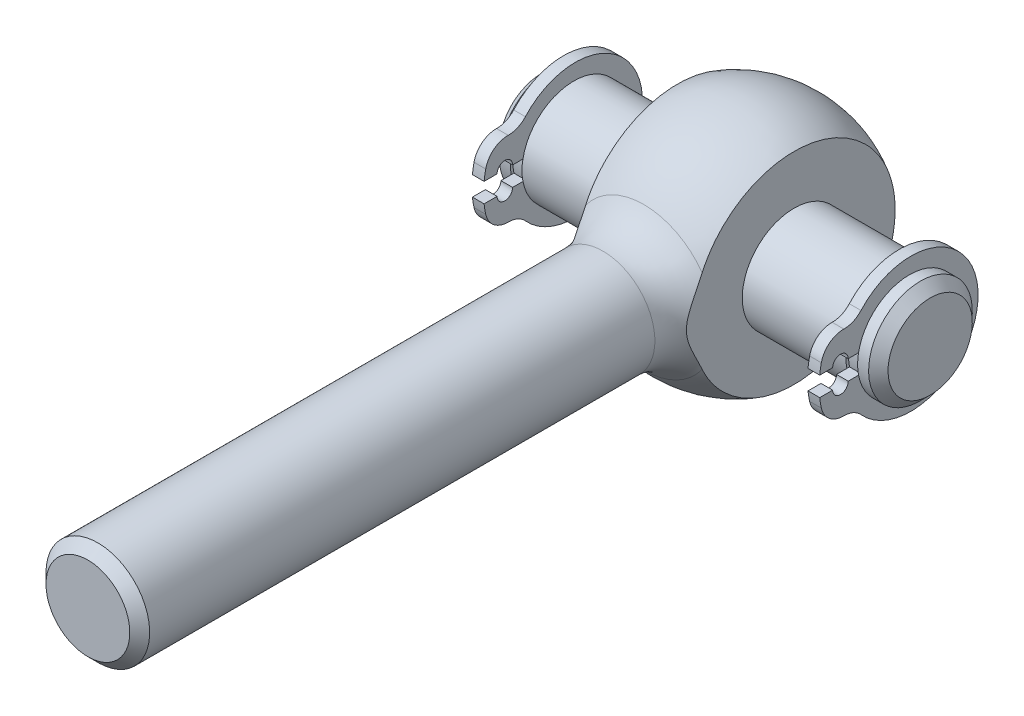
ISO-10303-21;
HEADER;
FILE_DESCRIPTION(('STEP AP214'),'2;1');
FILE_NAME('part.step','',(''),(''),'','','');
FILE_SCHEMA(('AUTOMOTIVE_DESIGN { 1 0 10303 214 1 1 1 1 }'));
ENDSEC;
DATA;
#1=APPLICATION_CONTEXT('core data for automotive mechanical design processes');
#2=APPLICATION_PROTOCOL_DEFINITION('international standard','automotive_design',2000,#1);
#3=PRODUCT_CONTEXT('',#1,'mechanical');
#4=PRODUCT('Part','Part','',(#3));
#5=PRODUCT_RELATED_PRODUCT_CATEGORY('part','',(#4));
#6=PRODUCT_DEFINITION_FORMATION('','',#4);
#7=PRODUCT_DEFINITION_CONTEXT('part definition',#1,'design');
#8=PRODUCT_DEFINITION('design','',#6,#7);
#9=PRODUCT_DEFINITION_SHAPE('','',#8);
#10=(LENGTH_UNIT() NAMED_UNIT(*) SI_UNIT(.MILLI.,.METRE.));
#11=(NAMED_UNIT(*) PLANE_ANGLE_UNIT() SI_UNIT($,.RADIAN.));
#12=(NAMED_UNIT(*) SI_UNIT($,.STERADIAN.) SOLID_ANGLE_UNIT());
#13=UNCERTAINTY_MEASURE_WITH_UNIT(LENGTH_MEASURE(1.E-05),#10,'distance_accuracy_value','');
#14=(GEOMETRIC_REPRESENTATION_CONTEXT(3) GLOBAL_UNCERTAINTY_ASSIGNED_CONTEXT((#13)) GLOBAL_UNIT_ASSIGNED_CONTEXT((#10,
#11,#12)) REPRESENTATION_CONTEXT('',''));
#15=CARTESIAN_POINT('',(0.,0.,0.));
#16=DIRECTION('',(0.,0.,1.));
#17=DIRECTION('',(1.,0.,0.));
#18=AXIS2_PLACEMENT_3D('',#15,#16,#17);
#19=CARTESIAN_POINT('',(-15.,0.,0.));
#20=DIRECTION('',(-1.,0.,0.));
#21=DIRECTION('',(0.,1.,0.));
#22=AXIS2_PLACEMENT_3D('',#19,#20,#21);
#23=PLANE('',#22);
#24=CARTESIAN_POINT('',(-15.,0.,0.));
#25=DIRECTION('',(-1.,0.,0.));
#26=DIRECTION('',(0.,1.,0.));
#27=AXIS2_PLACEMENT_3D('',#24,#25,#26);
#28=CIRCLE('',#27,3.25);
#29=CARTESIAN_POINT('',(-15.,3.25,0.));
#30=VERTEX_POINT('',#29);
#31=EDGE_CURVE('E540',#30,#30,#28,.T.);
#32=ORIENTED_EDGE('',*,*,#31,.T.);
#33=EDGE_LOOP('',(#32));
#34=FACE_BOUND('',#33,.T.);
#35=ADVANCED_FACE('F14',(#34),#23,.T.);
#36=CARTESIAN_POINT('',(-15.,0.,0.));
#37=DIRECTION('',(1.,0.,0.));
#38=DIRECTION('',(0.,-1.,0.));
#39=AXIS2_PLACEMENT_3D('',#36,#37,#38);
#40=CONICAL_SURFACE('',#39,3.25,0.785398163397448);
#41=CARTESIAN_POINT('',(-14.25,0.,0.));
#42=DIRECTION('',(-1.,0.,0.));
#43=DIRECTION('',(0.,1.,0.));
#44=AXIS2_PLACEMENT_3D('',#41,#42,#43);
#45=CIRCLE('',#44,4.);
#46=CARTESIAN_POINT('',(-14.25,4.,0.));
#47=VERTEX_POINT('',#46);
#48=EDGE_CURVE('E537',#47,#47,#45,.T.);
#49=ORIENTED_EDGE('',*,*,#48,.T.);
#50=EDGE_LOOP('',(#49));
#51=FACE_BOUND('',#50,.T.);
#52=ORIENTED_EDGE('',*,*,#31,.F.);
#53=EDGE_LOOP('',(#52));
#54=FACE_BOUND('',#53,.T.);
#55=ADVANCED_FACE('F625',(#51,#54),#40,.T.);
#56=CARTESIAN_POINT('',(15.,0.,0.));
#57=DIRECTION('',(-1.,0.,0.));
#58=DIRECTION('',(0.,1.,0.));
#59=AXIS2_PLACEMENT_3D('',#56,#57,#58);
#60=CYLINDRICAL_SURFACE('',#59,3.8);
#61=CARTESIAN_POINT('',(-12.5,0.,0.));
#62=DIRECTION('',(-1.,0.,0.));
#63=DIRECTION('',(0.,1.,0.));
#64=AXIS2_PLACEMENT_3D('',#61,#62,#63);
#65=CIRCLE('',#64,3.8);
#66=CARTESIAN_POINT('',(-12.5,-0.75,3.72525166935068));
#67=VERTEX_POINT('',#66);
#68=CARTESIAN_POINT('',(-12.5,0.75,3.72525166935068));
#69=VERTEX_POINT('',#68);
#70=EDGE_CURVE('E528',#67,#69,#65,.T.);
#71=ORIENTED_EDGE('',*,*,#70,.T.);
#72=DIRECTION('',(-1.,0.,0.));
#73=VECTOR('',#72,1.);
#74=CARTESIAN_POINT('',(15.,0.75,3.72525166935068));
#75=LINE('',#74,#73);
#76=CARTESIAN_POINT('',(-13.4,0.75,3.72525166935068));
#77=VERTEX_POINT('',#76);
#78=EDGE_CURVE('E33',#77,#69,#75,.F.);
#79=ORIENTED_EDGE('',*,*,#78,.F.);
#80=CARTESIAN_POINT('',(-13.4,0.,0.));
#81=DIRECTION('',(-1.,0.,0.));
#82=DIRECTION('',(0.,1.,0.));
#83=AXIS2_PLACEMENT_3D('',#80,#81,#82);
#84=CIRCLE('',#83,3.8);
#85=CARTESIAN_POINT('',(-13.4,-0.75,3.72525166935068));
#86=VERTEX_POINT('',#85);
#87=EDGE_CURVE('E531',#86,#77,#84,.T.);
#88=ORIENTED_EDGE('',*,*,#87,.F.);
#89=DIRECTION('',(-1.,0.,0.));
#90=VECTOR('',#89,1.);
#91=CARTESIAN_POINT('',(15.,-0.75,3.72525166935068));
#92=LINE('',#91,#90);
#93=EDGE_CURVE('E551',#67,#86,#92,.T.);
#94=ORIENTED_EDGE('',*,*,#93,.F.);
#95=EDGE_LOOP('',(#71,#79,#88,#94));
#96=FACE_BOUND('',#95,.T.);
#97=ADVANCED_FACE('F631',(#96),#60,.T.);
#98=CARTESIAN_POINT('',(-13.4,0.,-4.));
#99=DIRECTION('',(1.,0.,0.));
#100=DIRECTION('',(0.,-1.,0.));
#101=AXIS2_PLACEMENT_3D('',#98,#99,#100);
#102=PLANE('',#101);
#103=DIRECTION('',(0.,0.,-1.));
#104=VECTOR('',#103,1.);
#105=CARTESIAN_POINT('',(-13.4,0.75,-4.));
#106=LINE('',#105,#104);
#107=CARTESIAN_POINT('',(-13.4,0.75,3.92905841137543));
#108=VERTEX_POINT('',#107);
#109=EDGE_CURVE('E386',#108,#77,#106,.T.);
#110=ORIENTED_EDGE('',*,*,#109,.F.);
#111=CARTESIAN_POINT('',(-13.4,0.,0.));
#112=DIRECTION('',(-1.,0.,0.));
#113=DIRECTION('',(0.,1.,0.));
#114=AXIS2_PLACEMENT_3D('',#111,#112,#113);
#115=CIRCLE('',#114,4.);
#116=CARTESIAN_POINT('',(-13.4,-0.75,3.92905841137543));
#117=VERTEX_POINT('',#116);
#118=EDGE_CURVE('E534',#117,#108,#115,.T.);
#119=ORIENTED_EDGE('',*,*,#118,.F.);
#120=DIRECTION('',(0.,0.,1.));
#121=VECTOR('',#120,1.);
#122=CARTESIAN_POINT('',(-13.4,-0.75,-4.));
#123=LINE('',#122,#121);
#124=EDGE_CURVE('E382',#86,#117,#123,.T.);
#125=ORIENTED_EDGE('',*,*,#124,.F.);
#126=ORIENTED_EDGE('',*,*,#87,.T.);
#127=EDGE_LOOP('',(#110,#119,#125,#126));
#128=FACE_BOUND('',#127,.T.);
#129=ADVANCED_FACE('F639',(#128),#102,.T.);
#130=CARTESIAN_POINT('',(15.,0.,0.));
#131=DIRECTION('',(-1.,0.,0.));
#132=DIRECTION('',(0.,1.,0.));
#133=AXIS2_PLACEMENT_3D('',#130,#131,#132);
#134=CYLINDRICAL_SURFACE('',#133,4.);
#135=DIRECTION('',(-1.,0.,0.));
#136=VECTOR('',#135,1.);
#137=CARTESIAN_POINT('',(15.,0.75,3.92905841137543));
#138=LINE('',#137,#136);
#139=CARTESIAN_POINT('',(-13.401,0.75,3.92905841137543));
#140=VERTEX_POINT('',#139);
#141=EDGE_CURVE('E388',#140,#108,#138,.F.);
#142=ORIENTED_EDGE('',*,*,#141,.F.);
#143=CARTESIAN_POINT('',(-13.401,0.,0.));
#144=DIRECTION('',(-1.,0.,0.));
#145=DIRECTION('',(0.,0.,1.));
#146=AXIS2_PLACEMENT_3D('',#143,#144,#145);
#147=CIRCLE('',#146,4.);
#148=CARTESIAN_POINT('',(-13.401,-0.75,3.92905841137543));
#149=VERTEX_POINT('',#148);
#150=EDGE_CURVE('E282',#149,#140,#147,.F.);
#151=ORIENTED_EDGE('',*,*,#150,.F.);
#152=DIRECTION('',(-1.,0.,0.));
#153=VECTOR('',#152,1.);
#154=CARTESIAN_POINT('',(15.,-0.75,3.92905841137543));
#155=LINE('',#154,#153);
#156=EDGE_CURVE('E384',#117,#149,#155,.T.);
#157=ORIENTED_EDGE('',*,*,#156,.F.);
#158=ORIENTED_EDGE('',*,*,#118,.T.);
#159=EDGE_LOOP('',(#142,#151,#157,#158));
#160=FACE_BOUND('',#159,.T.);
#161=ORIENTED_EDGE('',*,*,#48,.F.);
#162=EDGE_LOOP('',(#161));
#163=FACE_BOUND('',#162,.T.);
#164=ADVANCED_FACE('F635',(#160,#163),#134,.T.);
#165=CARTESIAN_POINT('',(-13.401,-4.66213361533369,5.04639259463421));
#166=DIRECTION('',(-1.,0.,0.));
#167=DIRECTION('',(0.,0.,1.));
#168=AXIS2_PLACEMENT_3D('',#165,#166,#167);
#169=PLANE('',#168);
#170=DIRECTION('',(0.,0.,1.));
#171=VECTOR('',#170,1.);
#172=CARTESIAN_POINT('',(-13.401,-0.75,3.1622776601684));
#173=LINE('',#172,#171);
#174=CARTESIAN_POINT('',(-13.401,-0.75,4.725269));
#175=VERTEX_POINT('',#174);
#176=EDGE_CURVE('E344',#149,#175,#173,.T.);
#177=ORIENTED_EDGE('',*,*,#176,.F.);
#178=ORIENTED_EDGE('',*,*,#150,.T.);
#179=DIRECTION('',(0.,0.,-1.));
#180=VECTOR('',#179,1.);
#181=CARTESIAN_POINT('',(-13.401,0.75,4.725262));
#182=LINE('',#181,#180);
#183=CARTESIAN_POINT('',(-13.401,0.75,4.725262));
#184=VERTEX_POINT('',#183);
#185=EDGE_CURVE('E342',#184,#140,#182,.T.);
#186=ORIENTED_EDGE('',*,*,#185,.F.);
#187=CARTESIAN_POINT('',(-13.401,0.75,5.32526));
#188=DIRECTION('',(-1.,0.,0.));
#189=DIRECTION('',(0.,0.,1.));
#190=AXIS2_PLACEMENT_3D('',#187,#188,#189);
#191=CIRCLE('',#190,0.599998);
#192=CARTESIAN_POINT('',(-13.401,0.75,5.925258));
#193=VERTEX_POINT('',#192);
#194=EDGE_CURVE('E339',#193,#184,#191,.T.);
#195=ORIENTED_EDGE('',*,*,#194,.F.);
#196=DIRECTION('',(0.,0.,-1.));
#197=VECTOR('',#196,1.);
#198=CARTESIAN_POINT('',(-13.401,0.75,6.9252446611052));
#199=LINE('',#198,#197);
#200=CARTESIAN_POINT('',(-13.401,0.75,6.9252446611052));
#201=VERTEX_POINT('',#200);
#202=EDGE_CURVE('E336',#201,#193,#199,.T.);
#203=ORIENTED_EDGE('',*,*,#202,.F.);
#204=CARTESIAN_POINT('',(-13.401,-0.000326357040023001,-0.112427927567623));
#205=DIRECTION('',(1.,0.,0.));
#206=DIRECTION('',(0.,0.,-1.));
#207=AXIS2_PLACEMENT_3D('',#204,#205,#206);
#208=CIRCLE('',#207,7.07755784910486);
#209=CARTESIAN_POINT('',(-13.401,1.5168591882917,6.8006013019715));
#210=VERTEX_POINT('',#209);
#211=EDGE_CURVE('E333',#210,#201,#208,.T.);
#212=ORIENTED_EDGE('',*,*,#211,.F.);
#213=CARTESIAN_POINT('',(-13.401,1.13921273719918,5.08001562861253));
#214=DIRECTION('',(1.,0.,0.));
#215=DIRECTION('',(0.,0.,-1.));
#216=AXIS2_PLACEMENT_3D('',#213,#214,#215);
#217=CIRCLE('',#216,1.76154247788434);
#218=CARTESIAN_POINT('',(-13.401,2.9006750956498,5.063214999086));
#219=VERTEX_POINT('',#218);
#220=EDGE_CURVE('E330',#219,#210,#217,.T.);
#221=ORIENTED_EDGE('',*,*,#220,.F.);
#222=CARTESIAN_POINT('',(-13.401,4.66213608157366,5.04639514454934));
#223=DIRECTION('',(-1.,0.,0.));
#224=DIRECTION('',(0.,0.,-1.));
#225=AXIS2_PLACEMENT_3D('',#222,#223,#224);
#226=CIRCLE('',#225,1.76154128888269);
#227=CARTESIAN_POINT('',(-13.401,3.4807371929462,3.7397489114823));
#228=VERTEX_POINT('',#227);
#229=EDGE_CURVE('E327',#228,#219,#226,.T.);
#230=ORIENTED_EDGE('',*,*,#229,.F.);
#231=CARTESIAN_POINT('',(-13.401,8.23158323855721E-07,-0.110000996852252));
#232=DIRECTION('',(1.,0.,0.));
#233=DIRECTION('',(0.,0.,1.));
#234=AXIS2_PLACEMENT_3D('',#231,#232,#233);
#235=CIRCLE('',#234,5.19000000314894);
#236=CARTESIAN_POINT('',(-13.401,-3.4807374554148,3.7397471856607));
#237=VERTEX_POINT('',#236);
#238=EDGE_CURVE('E324',#237,#228,#235,.T.);
#239=ORIENTED_EDGE('',*,*,#238,.F.);
#240=CARTESIAN_POINT('',(-13.401,-4.66213361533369,5.04639259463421));
#241=DIRECTION('',(-1.,0.,0.));
#242=DIRECTION('',(0.,0.,-1.));
#243=AXIS2_PLACEMENT_3D('',#240,#241,#242);
#244=CIRCLE('',#243,1.76153884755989);
#245=CARTESIAN_POINT('',(-13.401,-2.9006750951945,5.0632149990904));
#246=VERTEX_POINT('',#245);
#247=EDGE_CURVE('E323',#246,#237,#244,.T.);
#248=ORIENTED_EDGE('',*,*,#247,.F.);
#249=CARTESIAN_POINT('',(-13.401,-1.13919695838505,5.08000675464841));
#250=DIRECTION('',(1.,0.,0.));
#251=DIRECTION('',(0.,0.,-1.));
#252=AXIS2_PLACEMENT_3D('',#249,#250,#251);
#253=CIRCLE('',#252,1.76155817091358);
#254=CARTESIAN_POINT('',(-13.401,-1.5168705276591,6.800602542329));
#255=VERTEX_POINT('',#254);
#256=EDGE_CURVE('E355',#255,#246,#253,.T.);
#257=ORIENTED_EDGE('',*,*,#256,.F.);
#258=CARTESIAN_POINT('',(-13.401,4.52933075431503E-05,-0.11033782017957));
#259=DIRECTION('',(1.,0.,0.));
#260=DIRECTION('',(0.,0.,-1.));
#261=AXIS2_PLACEMENT_3D('',#258,#259,#260);
#262=CIRCLE('',#261,7.0754597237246);
#263=CARTESIAN_POINT('',(-13.401,-0.75,6.9252547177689));
#264=VERTEX_POINT('',#263);
#265=EDGE_CURVE('E352',#264,#255,#262,.T.);
#266=ORIENTED_EDGE('',*,*,#265,.F.);
#267=DIRECTION('',(0.,0.,1.));
#268=VECTOR('',#267,1.);
#269=CARTESIAN_POINT('',(-13.401,-0.75,5.925251));
#270=LINE('',#269,#268);
#271=CARTESIAN_POINT('',(-13.401,-0.75,5.925251));
#272=VERTEX_POINT('',#271);
#273=EDGE_CURVE('E349',#272,#264,#270,.T.);
#274=ORIENTED_EDGE('',*,*,#273,.F.);
#275=CARTESIAN_POINT('',(-13.401,-0.75,5.32526));
#276=DIRECTION('',(-1.,0.,0.));
#277=DIRECTION('',(0.,0.,-1.));
#278=AXIS2_PLACEMENT_3D('',#275,#276,#277);
#279=CIRCLE('',#278,0.599991);
#280=EDGE_CURVE('E346',#175,#272,#279,.T.);
#281=ORIENTED_EDGE('',*,*,#280,.F.);
#282=EDGE_LOOP('',(#177,#178,#186,#195,#203,#212,#221,#230,#239,#248,#257,#266,#274,#281));
#283=FACE_BOUND('',#282,.T.);
#284=ADVANCED_FACE('F638',(#283),#169,.T.);
#285=CARTESIAN_POINT('',(-13.401,0.75,5.32526));
#286=DIRECTION('',(1.,0.,0.));
#287=DIRECTION('',(0.,-1.,0.));
#288=AXIS2_PLACEMENT_3D('',#285,#286,#287);
#289=CYLINDRICAL_SURFACE('',#288,0.599998);
#290=DIRECTION('',(1.,0.,0.));
#291=VECTOR('',#290,1.);
#292=CARTESIAN_POINT('',(-13.401,0.75,4.725262));
#293=LINE('',#292,#291);
#294=CARTESIAN_POINT('',(-12.499,0.75,4.725262));
#295=VERTEX_POINT('',#294);
#296=EDGE_CURVE('E369',#184,#295,#293,.T.);
#297=ORIENTED_EDGE('',*,*,#296,.T.);
#298=CARTESIAN_POINT('',(-12.499,0.75,5.32526));
#299=DIRECTION('',(-1.,0.,0.));
#300=DIRECTION('',(0.,0.,1.));
#301=AXIS2_PLACEMENT_3D('',#298,#299,#300);
#302=CIRCLE('',#301,0.599998);
#303=CARTESIAN_POINT('',(-12.499,0.75,5.925258));
#304=VERTEX_POINT('',#303);
#305=EDGE_CURVE('E295',#304,#295,#302,.T.);
#306=ORIENTED_EDGE('',*,*,#305,.F.);
#307=DIRECTION('',(1.,0.,0.));
#308=VECTOR('',#307,1.);
#309=CARTESIAN_POINT('',(-13.401,0.75,5.925258));
#310=LINE('',#309,#308);
#311=EDGE_CURVE('E371',#193,#304,#310,.T.);
#312=ORIENTED_EDGE('',*,*,#311,.F.);
#313=ORIENTED_EDGE('',*,*,#194,.T.);
#314=EDGE_LOOP('',(#297,#306,#312,#313));
#315=FACE_BOUND('',#314,.T.);
#316=ADVANCED_FACE('F762',(#315),#289,.F.);
#317=CARTESIAN_POINT('',(-13.401,0.75,6.9252446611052));
#318=DIRECTION('',(0.,-1.,0.));
#319=DIRECTION('',(-1.,0.,0.));
#320=AXIS2_PLACEMENT_3D('',#317,#318,#319);
#321=PLANE('',#320);
#322=ORIENTED_EDGE('',*,*,#311,.T.);
#323=DIRECTION('',(0.,0.,-1.));
#324=VECTOR('',#323,1.);
#325=CARTESIAN_POINT('',(-12.499,0.75,6.9252446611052));
#326=LINE('',#325,#324);
#327=CARTESIAN_POINT('',(-12.499,0.75,6.9252446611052));
#328=VERTEX_POINT('',#327);
#329=EDGE_CURVE('E300',#328,#304,#326,.T.);
#330=ORIENTED_EDGE('',*,*,#329,.F.);
#331=DIRECTION('',(1.,0.,0.));
#332=VECTOR('',#331,1.);
#333=CARTESIAN_POINT('',(-13.401,0.75,6.9252446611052));
#334=LINE('',#333,#332);
#335=EDGE_CURVE('E373',#201,#328,#334,.T.);
#336=ORIENTED_EDGE('',*,*,#335,.F.);
#337=ORIENTED_EDGE('',*,*,#202,.T.);
#338=EDGE_LOOP('',(#322,#330,#336,#337));
#339=FACE_BOUND('',#338,.T.);
#340=ADVANCED_FACE('F758',(#339),#321,.T.);
#341=CARTESIAN_POINT('',(-13.401,-0.000326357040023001,-0.112427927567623));
#342=DIRECTION('',(1.,0.,0.));
#343=DIRECTION('',(0.,-1.,0.));
#344=AXIS2_PLACEMENT_3D('',#341,#342,#343);
#345=CYLINDRICAL_SURFACE('',#344,7.07755784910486);
#346=ORIENTED_EDGE('',*,*,#335,.T.);
#347=CARTESIAN_POINT('',(-12.499,-0.00032635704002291,-0.112427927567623));
#348=DIRECTION('',(1.,0.,0.));
#349=DIRECTION('',(0.,0.,-1.));
#350=AXIS2_PLACEMENT_3D('',#347,#348,#349);
#351=CIRCLE('',#350,7.07755784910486);
#352=CARTESIAN_POINT('',(-12.499,1.5168591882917,6.8006013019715));
#353=VERTEX_POINT('',#352);
#354=EDGE_CURVE('E1658',#353,#328,#351,.T.);
#355=ORIENTED_EDGE('',*,*,#354,.F.);
#356=DIRECTION('',(1.,0.,0.));
#357=VECTOR('',#356,1.);
#358=CARTESIAN_POINT('',(-13.401,1.5168591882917,6.8006013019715));
#359=LINE('',#358,#357);
#360=EDGE_CURVE('E375',#210,#353,#359,.T.);
#361=ORIENTED_EDGE('',*,*,#360,.F.);
#362=ORIENTED_EDGE('',*,*,#211,.T.);
#363=EDGE_LOOP('',(#346,#355,#361,#362));
#364=FACE_BOUND('',#363,.T.);
#365=ADVANCED_FACE('F754',(#364),#345,.T.);
#366=CARTESIAN_POINT('',(-13.401,1.13921273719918,5.08001562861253));
#367=DIRECTION('',(1.,0.,0.));
#368=DIRECTION('',(0.,-1.,0.));
#369=AXIS2_PLACEMENT_3D('',#366,#367,#368);
#370=CYLINDRICAL_SURFACE('',#369,1.76154247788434);
#371=ORIENTED_EDGE('',*,*,#360,.T.);
#372=CARTESIAN_POINT('',(-12.499,1.13921273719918,5.08001562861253));
#373=DIRECTION('',(1.,0.,0.));
#374=DIRECTION('',(0.,0.,-1.));
#375=AXIS2_PLACEMENT_3D('',#372,#373,#374);
#376=CIRCLE('',#375,1.76154247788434);
#377=CARTESIAN_POINT('',(-12.499,2.9006750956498,5.063214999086));
#378=VERTEX_POINT('',#377);
#379=EDGE_CURVE('E1653',#378,#353,#376,.T.);
#380=ORIENTED_EDGE('',*,*,#379,.F.);
#381=DIRECTION('',(1.,0.,0.));
#382=VECTOR('',#381,1.);
#383=CARTESIAN_POINT('',(-13.401,2.9006750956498,5.063214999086));
#384=LINE('',#383,#382);
#385=EDGE_CURVE('E377',#219,#378,#384,.T.);
#386=ORIENTED_EDGE('',*,*,#385,.F.);
#387=ORIENTED_EDGE('',*,*,#220,.T.);
#388=EDGE_LOOP('',(#371,#380,#386,#387));
#389=FACE_BOUND('',#388,.T.);
#390=ADVANCED_FACE('F750',(#389),#370,.T.);
#391=CARTESIAN_POINT('',(-13.401,4.66213608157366,5.04639514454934));
#392=DIRECTION('',(1.,0.,0.));
#393=DIRECTION('',(0.,-1.,0.));
#394=AXIS2_PLACEMENT_3D('',#391,#392,#393);
#395=CYLINDRICAL_SURFACE('',#394,1.76154128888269);
#396=ORIENTED_EDGE('',*,*,#385,.T.);
#397=CARTESIAN_POINT('',(-12.499,4.66213608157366,5.04639514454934));
#398=DIRECTION('',(-1.,0.,0.));
#399=DIRECTION('',(0.,0.,-1.));
#400=AXIS2_PLACEMENT_3D('',#397,#398,#399);
#401=CIRCLE('',#400,1.76154128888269);
#402=CARTESIAN_POINT('',(-12.499,3.4807371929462,3.7397489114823));
#403=VERTEX_POINT('',#402);
#404=EDGE_CURVE('E1651',#403,#378,#401,.T.);
#405=ORIENTED_EDGE('',*,*,#404,.F.);
#406=DIRECTION('',(1.,0.,0.));
#407=VECTOR('',#406,1.);
#408=CARTESIAN_POINT('',(-13.401,3.4807371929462,3.7397489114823));
#409=LINE('',#408,#407);
#410=EDGE_CURVE('E379',#228,#403,#409,.T.);
#411=ORIENTED_EDGE('',*,*,#410,.F.);
#412=ORIENTED_EDGE('',*,*,#229,.T.);
#413=EDGE_LOOP('',(#396,#405,#411,#412));
#414=FACE_BOUND('',#413,.T.);
#415=ADVANCED_FACE('F746',(#414),#395,.F.);
#416=CARTESIAN_POINT('',(-13.401,8.23158323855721E-07,-0.110000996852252));
#417=DIRECTION('',(1.,0.,0.));
#418=DIRECTION('',(0.,-1.,0.));
#419=AXIS2_PLACEMENT_3D('',#416,#417,#418);
#420=CYLINDRICAL_SURFACE('',#419,5.19000000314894);
#421=ORIENTED_EDGE('',*,*,#410,.T.);
#422=CARTESIAN_POINT('',(-12.499,8.23158323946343E-07,-0.110000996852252));
#423=DIRECTION('',(1.,0.,0.));
#424=DIRECTION('',(0.,0.,1.));
#425=AXIS2_PLACEMENT_3D('',#422,#423,#424);
#426=CIRCLE('',#425,5.19000000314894);
#427=CARTESIAN_POINT('',(-12.499,-3.4807374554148,3.7397471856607));
#428=VERTEX_POINT('',#427);
#429=EDGE_CURVE('E318',#428,#403,#426,.T.);
#430=ORIENTED_EDGE('',*,*,#429,.F.);
#431=DIRECTION('',(1.,0.,0.));
#432=VECTOR('',#431,1.);
#433=CARTESIAN_POINT('',(-13.401,-3.4807374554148,3.7397471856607));
#434=LINE('',#433,#432);
#435=EDGE_CURVE('E64',#237,#428,#434,.T.);
#436=ORIENTED_EDGE('',*,*,#435,.F.);
#437=ORIENTED_EDGE('',*,*,#238,.T.);
#438=EDGE_LOOP('',(#421,#430,#436,#437));
#439=FACE_BOUND('',#438,.T.);
#440=ADVANCED_FACE('F743',(#439),#420,.T.);
#441=CARTESIAN_POINT('',(-13.401,-4.66213361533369,5.04639259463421));
#442=DIRECTION('',(1.,0.,0.));
#443=DIRECTION('',(0.,-1.,0.));
#444=AXIS2_PLACEMENT_3D('',#441,#442,#443);
#445=CYLINDRICAL_SURFACE('',#444,1.76153884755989);
#446=ORIENTED_EDGE('',*,*,#435,.T.);
#447=CARTESIAN_POINT('',(-12.499,-4.66213361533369,5.04639259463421));
#448=DIRECTION('',(-1.,0.,0.));
#449=DIRECTION('',(0.,0.,-1.));
#450=AXIS2_PLACEMENT_3D('',#447,#448,#449);
#451=CIRCLE('',#450,1.76153884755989);
#452=CARTESIAN_POINT('',(-12.499,-2.9006750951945,5.0632149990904));
#453=VERTEX_POINT('',#452);
#454=EDGE_CURVE('E315',#453,#428,#451,.T.);
#455=ORIENTED_EDGE('',*,*,#454,.F.);
#456=DIRECTION('',(1.,0.,0.));
#457=VECTOR('',#456,1.);
#458=CARTESIAN_POINT('',(-13.401,-2.9006750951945,5.0632149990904));
#459=LINE('',#458,#457);
#460=EDGE_CURVE('E358',#246,#453,#459,.T.);
#461=ORIENTED_EDGE('',*,*,#460,.F.);
#462=ORIENTED_EDGE('',*,*,#247,.T.);
#463=EDGE_LOOP('',(#446,#455,#461,#462));
#464=FACE_BOUND('',#463,.T.);
#465=ADVANCED_FACE('F739',(#464),#445,.F.);
#466=CARTESIAN_POINT('',(-13.401,-1.13919695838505,5.08000675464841));
#467=DIRECTION('',(1.,0.,0.));
#468=DIRECTION('',(0.,-1.,0.));
#469=AXIS2_PLACEMENT_3D('',#466,#467,#468);
#470=CYLINDRICAL_SURFACE('',#469,1.76155817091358);
#471=ORIENTED_EDGE('',*,*,#460,.T.);
#472=CARTESIAN_POINT('',(-12.499,-1.13919695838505,5.08000675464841));
#473=DIRECTION('',(1.,0.,0.));
#474=DIRECTION('',(0.,0.,-1.));
#475=AXIS2_PLACEMENT_3D('',#472,#473,#474);
#476=CIRCLE('',#475,1.76155817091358);
#477=CARTESIAN_POINT('',(-12.499,-1.5168705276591,6.800602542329));
#478=VERTEX_POINT('',#477);
#479=EDGE_CURVE('E312',#478,#453,#476,.T.);
#480=ORIENTED_EDGE('',*,*,#479,.F.);
#481=DIRECTION('',(1.,0.,0.));
#482=VECTOR('',#481,1.);
#483=CARTESIAN_POINT('',(-13.401,-1.5168705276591,6.800602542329));
#484=LINE('',#483,#482);
#485=EDGE_CURVE('E361',#255,#478,#484,.T.);
#486=ORIENTED_EDGE('',*,*,#485,.F.);
#487=ORIENTED_EDGE('',*,*,#256,.T.);
#488=EDGE_LOOP('',(#471,#480,#486,#487));
#489=FACE_BOUND('',#488,.T.);
#490=ADVANCED_FACE('F742',(#489),#470,.T.);
#491=CARTESIAN_POINT('',(-13.401,4.52933075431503E-05,-0.11033782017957));
#492=DIRECTION('',(1.,0.,0.));
#493=DIRECTION('',(0.,-1.,0.));
#494=AXIS2_PLACEMENT_3D('',#491,#492,#493);
#495=CYLINDRICAL_SURFACE('',#494,7.0754597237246);
#496=ORIENTED_EDGE('',*,*,#485,.T.);
#497=CARTESIAN_POINT('',(-12.499,4.52933075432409E-05,-0.11033782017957));
#498=DIRECTION('',(1.,0.,0.));
#499=DIRECTION('',(0.,0.,-1.));
#500=AXIS2_PLACEMENT_3D('',#497,#498,#499);
#501=CIRCLE('',#500,7.0754597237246);
#502=CARTESIAN_POINT('',(-12.499,-0.75,6.9252547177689));
#503=VERTEX_POINT('',#502);
#504=EDGE_CURVE('E309',#503,#478,#501,.T.);
#505=ORIENTED_EDGE('',*,*,#504,.F.);
#506=DIRECTION('',(1.,0.,0.));
#507=VECTOR('',#506,1.);
#508=CARTESIAN_POINT('',(-13.401,-0.75,6.9252547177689));
#509=LINE('',#508,#507);
#510=EDGE_CURVE('E363',#264,#503,#509,.T.);
#511=ORIENTED_EDGE('',*,*,#510,.F.);
#512=ORIENTED_EDGE('',*,*,#265,.T.);
#513=EDGE_LOOP('',(#496,#505,#511,#512));
#514=FACE_BOUND('',#513,.T.);
#515=ADVANCED_FACE('F779',(#514),#495,.T.);
#516=CARTESIAN_POINT('',(-13.401,-0.75,5.925251));
#517=DIRECTION('',(0.,1.,0.));
#518=DIRECTION('',(1.,0.,0.));
#519=AXIS2_PLACEMENT_3D('',#516,#517,#518);
#520=PLANE('',#519);
#521=ORIENTED_EDGE('',*,*,#510,.T.);
#522=DIRECTION('',(0.,0.,1.));
#523=VECTOR('',#522,1.);
#524=CARTESIAN_POINT('',(-12.499,-0.75,5.925251));
#525=LINE('',#524,#523);
#526=CARTESIAN_POINT('',(-12.499,-0.75,5.925251));
#527=VERTEX_POINT('',#526);
#528=EDGE_CURVE('E306',#527,#503,#525,.T.);
#529=ORIENTED_EDGE('',*,*,#528,.F.);
#530=DIRECTION('',(1.,0.,0.));
#531=VECTOR('',#530,1.);
#532=CARTESIAN_POINT('',(-13.401,-0.75,5.925251));
#533=LINE('',#532,#531);
#534=EDGE_CURVE('E365',#272,#527,#533,.T.);
#535=ORIENTED_EDGE('',*,*,#534,.F.);
#536=ORIENTED_EDGE('',*,*,#273,.T.);
#537=EDGE_LOOP('',(#521,#529,#535,#536));
#538=FACE_BOUND('',#537,.T.);
#539=ADVANCED_FACE('F775',(#538),#520,.T.);
#540=CARTESIAN_POINT('',(-13.401,-0.75,5.32526));
#541=DIRECTION('',(1.,0.,0.));
#542=DIRECTION('',(0.,-1.,0.));
#543=AXIS2_PLACEMENT_3D('',#540,#541,#542);
#544=CYLINDRICAL_SURFACE('',#543,0.599991);
#545=ORIENTED_EDGE('',*,*,#534,.T.);
#546=CARTESIAN_POINT('',(-12.499,-0.75,5.32526));
#547=DIRECTION('',(-1.,0.,0.));
#548=DIRECTION('',(0.,0.,-1.));
#549=AXIS2_PLACEMENT_3D('',#546,#547,#548);
#550=CIRCLE('',#549,0.599991);
#551=CARTESIAN_POINT('',(-12.499,-0.75,4.725269));
#552=VERTEX_POINT('',#551);
#553=EDGE_CURVE('E298',#552,#527,#550,.T.);
#554=ORIENTED_EDGE('',*,*,#553,.F.);
#555=DIRECTION('',(1.,0.,0.));
#556=VECTOR('',#555,1.);
#557=CARTESIAN_POINT('',(-13.401,-0.75,4.725269));
#558=LINE('',#557,#556);
#559=EDGE_CURVE('E367',#175,#552,#558,.T.);
#560=ORIENTED_EDGE('',*,*,#559,.F.);
#561=ORIENTED_EDGE('',*,*,#280,.T.);
#562=EDGE_LOOP('',(#545,#554,#560,#561));
#563=FACE_BOUND('',#562,.T.);
#564=ADVANCED_FACE('F771',(#563),#544,.F.);
#565=CARTESIAN_POINT('',(-13.401,-0.75,3.1622776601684));
#566=DIRECTION('',(0.,1.,0.));
#567=DIRECTION('',(1.,0.,0.));
#568=AXIS2_PLACEMENT_3D('',#565,#566,#567);
#569=PLANE('',#568);
#570=ORIENTED_EDGE('',*,*,#124,.T.);
#571=ORIENTED_EDGE('',*,*,#156,.T.);
#572=ORIENTED_EDGE('',*,*,#176,.T.);
#573=ORIENTED_EDGE('',*,*,#559,.T.);
#574=DIRECTION('',(0.,0.,1.));
#575=VECTOR('',#574,1.);
#576=CARTESIAN_POINT('',(-12.499,-0.75,3.1622776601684));
#577=LINE('',#576,#575);
#578=CARTESIAN_POINT('',(-12.499,-0.75,3.92905841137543));
#579=VERTEX_POINT('',#578);
#580=EDGE_CURVE('E296',#579,#552,#577,.T.);
#581=ORIENTED_EDGE('',*,*,#580,.F.);
#582=DIRECTION('',(-1.,0.,0.));
#583=VECTOR('',#582,1.);
#584=CARTESIAN_POINT('',(15.,-0.75,3.92905841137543));
#585=LINE('',#584,#583);
#586=CARTESIAN_POINT('',(-12.5,-0.75,3.92905841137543));
#587=VERTEX_POINT('',#586);
#588=EDGE_CURVE('E277',#587,#579,#585,.F.);
#589=ORIENTED_EDGE('',*,*,#588,.F.);
#590=DIRECTION('',(0.,0.,1.));
#591=VECTOR('',#590,1.);
#592=CARTESIAN_POINT('',(-12.5,-0.75,-3.8));
#593=LINE('',#592,#591);
#594=EDGE_CURVE('E289',#67,#587,#593,.T.);
#595=ORIENTED_EDGE('',*,*,#594,.F.);
#596=ORIENTED_EDGE('',*,*,#93,.T.);
#597=EDGE_LOOP('',(#570,#571,#572,#573,#581,#589,#595,#596));
#598=FACE_BOUND('',#597,.T.);
#599=ADVANCED_FACE('F650',(#598),#569,.T.);
#600=CARTESIAN_POINT('',(-12.5,0.,-3.8));
#601=DIRECTION('',(-1.,0.,0.));
#602=DIRECTION('',(0.,1.,0.));
#603=AXIS2_PLACEMENT_3D('',#600,#601,#602);
#604=PLANE('',#603);
#605=CARTESIAN_POINT('',(-12.5,0.,0.));
#606=DIRECTION('',(-1.,0.,0.));
#607=DIRECTION('',(0.,1.,0.));
#608=AXIS2_PLACEMENT_3D('',#605,#606,#607);
#609=CIRCLE('',#608,4.);
#610=CARTESIAN_POINT('',(-12.5,0.75,3.92905841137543));
#611=VERTEX_POINT('',#610);
#612=EDGE_CURVE('E526',#587,#611,#609,.T.);
#613=ORIENTED_EDGE('',*,*,#612,.T.);
#614=DIRECTION('',(0.,0.,-1.));
#615=VECTOR('',#614,1.);
#616=CARTESIAN_POINT('',(-12.5,0.75,-3.8));
#617=LINE('',#616,#615);
#618=EDGE_CURVE('E288',#611,#69,#617,.T.);
#619=ORIENTED_EDGE('',*,*,#618,.T.);
#620=ORIENTED_EDGE('',*,*,#70,.F.);
#621=ORIENTED_EDGE('',*,*,#594,.T.);
#622=EDGE_LOOP('',(#613,#619,#620,#621));
#623=FACE_BOUND('',#622,.T.);
#624=ADVANCED_FACE('F647',(#623),#604,.T.);
#625=CARTESIAN_POINT('',(-13.401,0.75,4.725262));
#626=DIRECTION('',(0.,-1.,0.));
#627=DIRECTION('',(-1.,0.,0.));
#628=AXIS2_PLACEMENT_3D('',#625,#626,#627);
#629=PLANE('',#628);
#630=ORIENTED_EDGE('',*,*,#185,.T.);
#631=ORIENTED_EDGE('',*,*,#141,.T.);
#632=ORIENTED_EDGE('',*,*,#109,.T.);
#633=ORIENTED_EDGE('',*,*,#78,.T.);
#634=ORIENTED_EDGE('',*,*,#618,.F.);
#635=DIRECTION('',(-1.,0.,0.));
#636=VECTOR('',#635,1.);
#637=CARTESIAN_POINT('',(15.,0.75,3.92905841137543));
#638=LINE('',#637,#636);
#639=CARTESIAN_POINT('',(-12.499,0.75,3.92905841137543));
#640=VERTEX_POINT('',#639);
#641=EDGE_CURVE('E274',#640,#611,#638,.T.);
#642=ORIENTED_EDGE('',*,*,#641,.F.);
#643=DIRECTION('',(0.,0.,-1.));
#644=VECTOR('',#643,1.);
#645=CARTESIAN_POINT('',(-12.499,0.75,4.725262));
#646=LINE('',#645,#644);
#647=EDGE_CURVE('E287',#295,#640,#646,.T.);
#648=ORIENTED_EDGE('',*,*,#647,.F.);
#649=ORIENTED_EDGE('',*,*,#296,.F.);
#650=EDGE_LOOP('',(#630,#631,#632,#633,#634,#642,#648,#649));
#651=FACE_BOUND('',#650,.T.);
#652=ADVANCED_FACE('F286',(#651),#629,.T.);
#653=CARTESIAN_POINT('',(-12.499,-4.66213361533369,5.04639259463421));
#654=DIRECTION('',(-1.,0.,0.));
#655=DIRECTION('',(0.,0.,1.));
#656=AXIS2_PLACEMENT_3D('',#653,#654,#655);
#657=PLANE('',#656);
#658=CARTESIAN_POINT('',(-12.499,0.,0.));
#659=DIRECTION('',(-1.,0.,0.));
#660=DIRECTION('',(0.,0.,1.));
#661=AXIS2_PLACEMENT_3D('',#658,#659,#660);
#662=CIRCLE('',#661,4.);
#663=EDGE_CURVE('E270',#579,#640,#662,.F.);
#664=ORIENTED_EDGE('',*,*,#663,.F.);
#665=ORIENTED_EDGE('',*,*,#580,.T.);
#666=ORIENTED_EDGE('',*,*,#553,.T.);
#667=ORIENTED_EDGE('',*,*,#528,.T.);
#668=ORIENTED_EDGE('',*,*,#504,.T.);
#669=ORIENTED_EDGE('',*,*,#479,.T.);
#670=ORIENTED_EDGE('',*,*,#454,.T.);
#671=ORIENTED_EDGE('',*,*,#429,.T.);
#672=ORIENTED_EDGE('',*,*,#404,.T.);
#673=ORIENTED_EDGE('',*,*,#379,.T.);
#674=ORIENTED_EDGE('',*,*,#354,.T.);
#675=ORIENTED_EDGE('',*,*,#329,.T.);
#676=ORIENTED_EDGE('',*,*,#305,.T.);
#677=ORIENTED_EDGE('',*,*,#647,.T.);
#678=EDGE_LOOP('',(#664,#665,#666,#667,#668,#669,#670,#671,#672,#673,#674,#675,#676,#677));
#679=FACE_BOUND('',#678,.T.);
#680=ADVANCED_FACE('F292',(#679),#657,.F.);
#681=CARTESIAN_POINT('',(15.,0.,0.));
#682=DIRECTION('',(-1.,0.,0.));
#683=DIRECTION('',(0.,1.,0.));
#684=AXIS2_PLACEMENT_3D('',#681,#682,#683);
#685=CYLINDRICAL_SURFACE('',#684,4.);
#686=CARTESIAN_POINT('',(-4.5,0.,0.));
#687=DIRECTION('',(1.,0.,0.));
#688=DIRECTION('',(0.,0.,-1.));
#689=AXIS2_PLACEMENT_3D('',#686,#687,#688);
#690=CIRCLE('',#689,4.);
#691=CARTESIAN_POINT('',(-4.5,0.,-4.));
#692=VERTEX_POINT('',#691);
#693=EDGE_CURVE('E18',#692,#692,#690,.T.);
#694=ORIENTED_EDGE('',*,*,#693,.F.);
#695=EDGE_LOOP('',(#694));
#696=FACE_BOUND('',#695,.T.);
#697=ORIENTED_EDGE('',*,*,#663,.T.);
#698=ORIENTED_EDGE('',*,*,#641,.T.);
#699=ORIENTED_EDGE('',*,*,#612,.F.);
#700=ORIENTED_EDGE('',*,*,#588,.T.);
#701=EDGE_LOOP('',(#697,#698,#699,#700));
#702=FACE_BOUND('',#701,.T.);
#703=ADVANCED_FACE('F272',(#696,#702),#685,.T.);
#704=DIRECTION('',(-1.,0.,0.));
#705=VECTOR('',#704,1.);
#706=CARTESIAN_POINT('',(15.,0.75,3.92905841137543));
#707=LINE('',#706,#705);
#708=CARTESIAN_POINT('',(12.499,0.75,3.92905841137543));
#709=VERTEX_POINT('',#708);
#710=CARTESIAN_POINT('',(12.5,0.75,3.92905841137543));
#711=VERTEX_POINT('',#710);
#712=EDGE_CURVE('E506',#709,#711,#707,.F.);
#713=ORIENTED_EDGE('',*,*,#712,.F.);
#714=CARTESIAN_POINT('',(12.499,0.,0.));
#715=DIRECTION('',(-1.,0.,0.));
#716=DIRECTION('',(0.,0.,1.));
#717=AXIS2_PLACEMENT_3D('',#714,#715,#716);
#718=CIRCLE('',#717,4.);
#719=CARTESIAN_POINT('',(12.499,-0.75,3.92905841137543));
#720=VERTEX_POINT('',#719);
#721=EDGE_CURVE('E547',#720,#709,#718,.F.);
#722=ORIENTED_EDGE('',*,*,#721,.F.);
#723=DIRECTION('',(-1.,0.,0.));
#724=VECTOR('',#723,1.);
#725=CARTESIAN_POINT('',(15.,-0.75,3.92905841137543));
#726=LINE('',#725,#724);
#727=CARTESIAN_POINT('',(12.5,-0.75,3.92905841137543));
#728=VERTEX_POINT('',#727);
#729=EDGE_CURVE('E502',#728,#720,#726,.T.);
#730=ORIENTED_EDGE('',*,*,#729,.F.);
#731=CARTESIAN_POINT('',(12.5,0.,0.));
#732=DIRECTION('',(-1.,0.,0.));
#733=DIRECTION('',(0.,1.,0.));
#734=AXIS2_PLACEMENT_3D('',#731,#732,#733);
#735=CIRCLE('',#734,4.);
#736=EDGE_CURVE('E523',#728,#711,#735,.T.);
#737=ORIENTED_EDGE('',*,*,#736,.T.);
#738=EDGE_LOOP('',(#713,#722,#730,#737));
#739=FACE_BOUND('',#738,.T.);
#740=CARTESIAN_POINT('',(4.5,0.,0.));
#741=DIRECTION('',(1.,0.,0.));
#742=DIRECTION('',(0.,0.,1.));
#743=AXIS2_PLACEMENT_3D('',#740,#741,#742);
#744=CIRCLE('',#743,4.);
#745=CARTESIAN_POINT('',(4.5,0.,4.));
#746=VERTEX_POINT('',#745);
#747=EDGE_CURVE('E9',#746,#746,#744,.T.);
#748=ORIENTED_EDGE('',*,*,#747,.T.);
#749=EDGE_LOOP('',(#748));
#750=FACE_BOUND('',#749,.T.);
#751=ADVANCED_FACE('F654',(#739,#750),#685,.T.);
#752=CARTESIAN_POINT('',(15.,0.,0.));
#753=DIRECTION('',(-1.,0.,0.));
#754=DIRECTION('',(0.,1.,0.));
#755=AXIS2_PLACEMENT_3D('',#752,#753,#754);
#756=CYLINDRICAL_SURFACE('',#755,3.8);
#757=CARTESIAN_POINT('',(13.4,0.,0.));
#758=DIRECTION('',(-1.,0.,0.));
#759=DIRECTION('',(0.,1.,0.));
#760=AXIS2_PLACEMENT_3D('',#757,#758,#759);
#761=CIRCLE('',#760,3.8);
#762=CARTESIAN_POINT('',(13.4,-0.75,3.72525166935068));
#763=VERTEX_POINT('',#762);
#764=CARTESIAN_POINT('',(13.4,0.75,3.72525166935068));
#765=VERTEX_POINT('',#764);
#766=EDGE_CURVE('E517',#763,#765,#761,.T.);
#767=ORIENTED_EDGE('',*,*,#766,.T.);
#768=DIRECTION('',(-1.,0.,0.));
#769=VECTOR('',#768,1.);
#770=CARTESIAN_POINT('',(15.,0.75,3.72525166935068));
#771=LINE('',#770,#769);
#772=CARTESIAN_POINT('',(12.5,0.75,3.72525166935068));
#773=VERTEX_POINT('',#772);
#774=EDGE_CURVE('E545',#773,#765,#771,.F.);
#775=ORIENTED_EDGE('',*,*,#774,.F.);
#776=CARTESIAN_POINT('',(12.5,0.,0.));
#777=DIRECTION('',(-1.,0.,0.));
#778=DIRECTION('',(0.,1.,0.));
#779=AXIS2_PLACEMENT_3D('',#776,#777,#778);
#780=CIRCLE('',#779,3.8);
#781=CARTESIAN_POINT('',(12.5,-0.75,3.72525166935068));
#782=VERTEX_POINT('',#781);
#783=EDGE_CURVE('E520',#782,#773,#780,.T.);
#784=ORIENTED_EDGE('',*,*,#783,.F.);
#785=DIRECTION('',(-1.,0.,0.));
#786=VECTOR('',#785,1.);
#787=CARTESIAN_POINT('',(15.,-0.75,3.72525166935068));
#788=LINE('',#787,#786);
#789=EDGE_CURVE('E543',#763,#782,#788,.T.);
#790=ORIENTED_EDGE('',*,*,#789,.F.);
#791=EDGE_LOOP('',(#767,#775,#784,#790));
#792=FACE_BOUND('',#791,.T.);
#793=ADVANCED_FACE('F662',(#792),#756,.T.);
#794=CARTESIAN_POINT('',(13.4,0.,-3.8));
#795=DIRECTION('',(-1.,0.,0.));
#796=DIRECTION('',(0.,1.,0.));
#797=AXIS2_PLACEMENT_3D('',#794,#795,#796);
#798=PLANE('',#797);
#799=CARTESIAN_POINT('',(13.4,0.,0.));
#800=DIRECTION('',(-1.,0.,0.));
#801=DIRECTION('',(0.,1.,0.));
#802=AXIS2_PLACEMENT_3D('',#799,#800,#801);
#803=CIRCLE('',#802,4.);
#804=CARTESIAN_POINT('',(13.4,-0.75,3.92905841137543));
#805=VERTEX_POINT('',#804);
#806=CARTESIAN_POINT('',(13.4,0.75,3.92905841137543));
#807=VERTEX_POINT('',#806);
#808=EDGE_CURVE('E514',#805,#807,#803,.T.);
#809=ORIENTED_EDGE('',*,*,#808,.T.);
#810=DIRECTION('',(0.,0.,-1.));
#811=VECTOR('',#810,1.);
#812=CARTESIAN_POINT('',(13.4,0.75,-3.8));
#813=LINE('',#812,#811);
#814=EDGE_CURVE('E435',#807,#765,#813,.T.);
#815=ORIENTED_EDGE('',*,*,#814,.T.);
#816=ORIENTED_EDGE('',*,*,#766,.F.);
#817=DIRECTION('',(0.,0.,1.));
#818=VECTOR('',#817,1.);
#819=CARTESIAN_POINT('',(13.4,-0.75,-3.8));
#820=LINE('',#819,#818);
#821=EDGE_CURVE('E431',#763,#805,#820,.T.);
#822=ORIENTED_EDGE('',*,*,#821,.T.);
#823=EDGE_LOOP('',(#809,#815,#816,#822));
#824=FACE_BOUND('',#823,.T.);
#825=ADVANCED_FACE('F665',(#824),#798,.T.);
#826=CARTESIAN_POINT('',(15.,0.,0.));
#827=DIRECTION('',(-1.,0.,0.));
#828=DIRECTION('',(0.,1.,0.));
#829=AXIS2_PLACEMENT_3D('',#826,#827,#828);
#830=CYLINDRICAL_SURFACE('',#829,4.);
#831=CARTESIAN_POINT('',(14.25,0.,0.));
#832=DIRECTION('',(-1.,0.,0.));
#833=DIRECTION('',(0.,1.,0.));
#834=AXIS2_PLACEMENT_3D('',#831,#832,#833);
#835=CIRCLE('',#834,4.);
#836=CARTESIAN_POINT('',(14.25,4.,0.));
#837=VERTEX_POINT('',#836);
#838=EDGE_CURVE('E511',#837,#837,#835,.T.);
#839=ORIENTED_EDGE('',*,*,#838,.T.);
#840=EDGE_LOOP('',(#839));
#841=FACE_BOUND('',#840,.T.);
#842=CARTESIAN_POINT('',(13.401,0.,0.));
#843=DIRECTION('',(-1.,0.,0.));
#844=DIRECTION('',(0.,0.,1.));
#845=AXIS2_PLACEMENT_3D('',#842,#843,#844);
#846=CIRCLE('',#845,4.);
#847=CARTESIAN_POINT('',(13.401,-0.75,3.92905841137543));
#848=VERTEX_POINT('',#847);
#849=CARTESIAN_POINT('',(13.401,0.75,3.92905841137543));
#850=VERTEX_POINT('',#849);
#851=EDGE_CURVE('E549',#848,#850,#846,.F.);
#852=ORIENTED_EDGE('',*,*,#851,.T.);
#853=DIRECTION('',(-1.,0.,0.));
#854=VECTOR('',#853,1.);
#855=CARTESIAN_POINT('',(15.,0.75,3.92905841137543));
#856=LINE('',#855,#854);
#857=EDGE_CURVE('E433',#850,#807,#856,.T.);
#858=ORIENTED_EDGE('',*,*,#857,.T.);
#859=ORIENTED_EDGE('',*,*,#808,.F.);
#860=DIRECTION('',(-1.,0.,0.));
#861=VECTOR('',#860,1.);
#862=CARTESIAN_POINT('',(15.,-0.75,3.92905841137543));
#863=LINE('',#862,#861);
#864=EDGE_CURVE('E427',#805,#848,#863,.F.);
#865=ORIENTED_EDGE('',*,*,#864,.T.);
#866=EDGE_LOOP('',(#852,#858,#859,#865));
#867=FACE_BOUND('',#866,.T.);
#868=ADVANCED_FACE('F660',(#841,#867),#830,.T.);
#869=CARTESIAN_POINT('',(12.5,0.,-4.));
#870=DIRECTION('',(1.,0.,0.));
#871=DIRECTION('',(0.,-1.,0.));
#872=AXIS2_PLACEMENT_3D('',#869,#870,#871);
#873=PLANE('',#872);
#874=DIRECTION('',(0.,0.,-1.));
#875=VECTOR('',#874,1.);
#876=CARTESIAN_POINT('',(12.5,0.75,-4.));
#877=LINE('',#876,#875);
#878=EDGE_CURVE('E504',#711,#773,#877,.T.);
#879=ORIENTED_EDGE('',*,*,#878,.F.);
#880=ORIENTED_EDGE('',*,*,#736,.F.);
#881=DIRECTION('',(0.,0.,1.));
#882=VECTOR('',#881,1.);
#883=CARTESIAN_POINT('',(12.5,-0.75,-4.));
#884=LINE('',#883,#882);
#885=EDGE_CURVE('E500',#782,#728,#884,.T.);
#886=ORIENTED_EDGE('',*,*,#885,.F.);
#887=ORIENTED_EDGE('',*,*,#783,.T.);
#888=EDGE_LOOP('',(#879,#880,#886,#887));
#889=FACE_BOUND('',#888,.T.);
#890=ADVANCED_FACE('F656',(#889),#873,.T.);
#891=CARTESIAN_POINT('',(14.25,0.,0.));
#892=DIRECTION('',(-1.,0.,0.));
#893=DIRECTION('',(0.,1.,0.));
#894=AXIS2_PLACEMENT_3D('',#891,#892,#893);
#895=CONICAL_SURFACE('',#894,4.,0.785398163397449);
#896=CARTESIAN_POINT('',(15.,0.,0.));
#897=DIRECTION('',(-1.,0.,0.));
#898=DIRECTION('',(0.,1.,0.));
#899=AXIS2_PLACEMENT_3D('',#896,#897,#898);
#900=CIRCLE('',#899,3.25);
#901=CARTESIAN_POINT('',(15.,3.25,0.));
#902=VERTEX_POINT('',#901);
#903=EDGE_CURVE('E508',#902,#902,#900,.T.);
#904=ORIENTED_EDGE('',*,*,#903,.T.);
#905=EDGE_LOOP('',(#904));
#906=FACE_BOUND('',#905,.T.);
#907=ORIENTED_EDGE('',*,*,#838,.F.);
#908=EDGE_LOOP('',(#907));
#909=FACE_BOUND('',#908,.T.);
#910=ADVANCED_FACE('F659',(#906,#909),#895,.T.);
#911=CARTESIAN_POINT('',(15.,0.,-3.25));
#912=DIRECTION('',(1.,0.,0.));
#913=DIRECTION('',(0.,-1.,0.));
#914=AXIS2_PLACEMENT_3D('',#911,#912,#913);
#915=PLANE('',#914);
#916=ORIENTED_EDGE('',*,*,#903,.F.);
#917=EDGE_LOOP('',(#916));
#918=FACE_BOUND('',#917,.T.);
#919=ADVANCED_FACE('F675',(#918),#915,.T.);
#920=CARTESIAN_POINT('',(12.499,-4.66213361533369,5.04639259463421));
#921=DIRECTION('',(1.,0.,0.));
#922=DIRECTION('',(0.,-1.,0.));
#923=AXIS2_PLACEMENT_3D('',#920,#921,#922);
#924=CYLINDRICAL_SURFACE('',#923,1.76153884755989);
#925=DIRECTION('',(1.,0.,0.));
#926=VECTOR('',#925,1.);
#927=CARTESIAN_POINT('',(12.499,-3.4807374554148,3.7397471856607));
#928=LINE('',#927,#926);
#929=CARTESIAN_POINT('',(12.499,-3.4807374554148,3.7397471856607));
#930=VERTEX_POINT('',#929);
#931=CARTESIAN_POINT('',(13.401,-3.4807374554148,3.7397471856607));
#932=VERTEX_POINT('',#931);
#933=EDGE_CURVE('E498',#930,#932,#928,.T.);
#934=ORIENTED_EDGE('',*,*,#933,.T.);
#935=CARTESIAN_POINT('',(13.401,-4.66213361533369,5.04639259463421));
#936=DIRECTION('',(-1.,0.,0.));
#937=DIRECTION('',(0.,0.,-1.));
#938=AXIS2_PLACEMENT_3D('',#935,#936,#937);
#939=CIRCLE('',#938,1.76153884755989);
#940=CARTESIAN_POINT('',(13.401,-2.9006750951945,5.0632149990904));
#941=VERTEX_POINT('',#940);
#942=EDGE_CURVE('E390',#941,#932,#939,.T.);
#943=ORIENTED_EDGE('',*,*,#942,.F.);
#944=DIRECTION('',(1.,0.,0.));
#945=VECTOR('',#944,1.);
#946=CARTESIAN_POINT('',(12.499,-2.9006750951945,5.0632149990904));
#947=LINE('',#946,#945);
#948=CARTESIAN_POINT('',(12.499,-2.9006750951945,5.0632149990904));
#949=VERTEX_POINT('',#948);
#950=EDGE_CURVE('E474',#949,#941,#947,.T.);
#951=ORIENTED_EDGE('',*,*,#950,.F.);
#952=CARTESIAN_POINT('',(12.499,-4.66213361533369,5.04639259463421));
#953=DIRECTION('',(-1.,0.,0.));
#954=DIRECTION('',(0.,0.,-1.));
#955=AXIS2_PLACEMENT_3D('',#952,#953,#954);
#956=CIRCLE('',#955,1.76153884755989);
#957=EDGE_CURVE('E438',#949,#930,#956,.T.);
#958=ORIENTED_EDGE('',*,*,#957,.T.);
#959=EDGE_LOOP('',(#934,#943,#951,#958));
#960=FACE_BOUND('',#959,.T.);
#961=ADVANCED_FACE('F679',(#960),#924,.F.);
#962=CARTESIAN_POINT('',(12.499,8.2315832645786E-07,-0.110000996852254));
#963=DIRECTION('',(1.,0.,0.));
#964=DIRECTION('',(0.,-1.,0.));
#965=AXIS2_PLACEMENT_3D('',#962,#963,#964);
#966=CYLINDRICAL_SURFACE('',#965,5.19000000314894);
#967=DIRECTION('',(1.,0.,0.));
#968=VECTOR('',#967,1.);
#969=CARTESIAN_POINT('',(12.499,3.4807371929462,3.7397489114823));
#970=LINE('',#969,#968);
#971=CARTESIAN_POINT('',(12.499,3.4807371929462,3.7397489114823));
#972=VERTEX_POINT('',#971);
#973=CARTESIAN_POINT('',(13.401,3.4807371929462,3.7397489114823));
#974=VERTEX_POINT('',#973);
#975=EDGE_CURVE('E496',#972,#974,#970,.T.);
#976=ORIENTED_EDGE('',*,*,#975,.T.);
#977=CARTESIAN_POINT('',(13.401,8.23158326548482E-07,-0.110000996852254));
#978=DIRECTION('',(1.,0.,0.));
#979=DIRECTION('',(0.,0.,1.));
#980=AXIS2_PLACEMENT_3D('',#977,#978,#979);
#981=CIRCLE('',#980,5.19000000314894);
#982=EDGE_CURVE('E391',#932,#974,#981,.T.);
#983=ORIENTED_EDGE('',*,*,#982,.F.);
#984=ORIENTED_EDGE('',*,*,#933,.F.);
#985=CARTESIAN_POINT('',(12.499,8.2315832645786E-07,-0.110000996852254));
#986=DIRECTION('',(1.,0.,0.));
#987=DIRECTION('',(0.,0.,1.));
#988=AXIS2_PLACEMENT_3D('',#985,#986,#987);
#989=CIRCLE('',#988,5.19000000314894);
#990=EDGE_CURVE('E439',#930,#972,#989,.T.);
#991=ORIENTED_EDGE('',*,*,#990,.T.);
#992=EDGE_LOOP('',(#976,#983,#984,#991));
#993=FACE_BOUND('',#992,.T.);
#994=ADVANCED_FACE('F683',(#993),#966,.T.);
#995=CARTESIAN_POINT('',(12.499,4.66213608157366,5.04639514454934));
#996=DIRECTION('',(1.,0.,0.));
#997=DIRECTION('',(0.,-1.,0.));
#998=AXIS2_PLACEMENT_3D('',#995,#996,#997);
#999=CYLINDRICAL_SURFACE('',#998,1.76154128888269);
#1000=DIRECTION('',(1.,0.,0.));
#1001=VECTOR('',#1000,1.);
#1002=CARTESIAN_POINT('',(12.499,2.9006750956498,5.063214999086));
#1003=LINE('',#1002,#1001);
#1004=CARTESIAN_POINT('',(12.499,2.9006750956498,5.063214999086));
#1005=VERTEX_POINT('',#1004);
#1006=CARTESIAN_POINT('',(13.401,2.9006750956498,5.063214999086));
#1007=VERTEX_POINT('',#1006);
#1008=EDGE_CURVE('E494',#1005,#1007,#1003,.T.);
#1009=ORIENTED_EDGE('',*,*,#1008,.T.);
#1010=CARTESIAN_POINT('',(13.401,4.66213608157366,5.04639514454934));
#1011=DIRECTION('',(-1.,0.,0.));
#1012=DIRECTION('',(0.,0.,-1.));
#1013=AXIS2_PLACEMENT_3D('',#1010,#1011,#1012);
#1014=CIRCLE('',#1013,1.76154128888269);
#1015=EDGE_CURVE('E394',#974,#1007,#1014,.T.);
#1016=ORIENTED_EDGE('',*,*,#1015,.F.);
#1017=ORIENTED_EDGE('',*,*,#975,.F.);
#1018=CARTESIAN_POINT('',(12.499,4.66213608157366,5.04639514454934));
#1019=DIRECTION('',(-1.,0.,0.));
#1020=DIRECTION('',(0.,0.,-1.));
#1021=AXIS2_PLACEMENT_3D('',#1018,#1019,#1020);
#1022=CIRCLE('',#1021,1.76154128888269);
#1023=EDGE_CURVE('E442',#972,#1005,#1022,.T.);
#1024=ORIENTED_EDGE('',*,*,#1023,.T.);
#1025=EDGE_LOOP('',(#1009,#1016,#1017,#1024));
#1026=FACE_BOUND('',#1025,.T.);
#1027=ADVANCED_FACE('F687',(#1026),#999,.F.);
#1028=CARTESIAN_POINT('',(12.499,1.13921273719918,5.08001562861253));
#1029=DIRECTION('',(1.,0.,0.));
#1030=DIRECTION('',(0.,-1.,0.));
#1031=AXIS2_PLACEMENT_3D('',#1028,#1029,#1030);
#1032=CYLINDRICAL_SURFACE('',#1031,1.76154247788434);
#1033=DIRECTION('',(1.,0.,0.));
#1034=VECTOR('',#1033,1.);
#1035=CARTESIAN_POINT('',(12.499,1.5168591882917,6.8006013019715));
#1036=LINE('',#1035,#1034);
#1037=CARTESIAN_POINT('',(12.499,1.5168591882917,6.8006013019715));
#1038=VERTEX_POINT('',#1037);
#1039=CARTESIAN_POINT('',(13.401,1.5168591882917,6.8006013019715));
#1040=VERTEX_POINT('',#1039);
#1041=EDGE_CURVE('E492',#1038,#1040,#1036,.T.);
#1042=ORIENTED_EDGE('',*,*,#1041,.T.);
#1043=CARTESIAN_POINT('',(13.401,1.13921273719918,5.08001562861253));
#1044=DIRECTION('',(1.,0.,0.));
#1045=DIRECTION('',(0.,0.,-1.));
#1046=AXIS2_PLACEMENT_3D('',#1043,#1044,#1045);
#1047=CIRCLE('',#1046,1.76154247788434);
#1048=EDGE_CURVE('E397',#1007,#1040,#1047,.T.);
#1049=ORIENTED_EDGE('',*,*,#1048,.F.);
#1050=ORIENTED_EDGE('',*,*,#1008,.F.);
#1051=CARTESIAN_POINT('',(12.499,1.13921273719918,5.08001562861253));
#1052=DIRECTION('',(1.,0.,0.));
#1053=DIRECTION('',(0.,0.,-1.));
#1054=AXIS2_PLACEMENT_3D('',#1051,#1052,#1053);
#1055=CIRCLE('',#1054,1.76154247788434);
#1056=EDGE_CURVE('E445',#1005,#1038,#1055,.T.);
#1057=ORIENTED_EDGE('',*,*,#1056,.T.);
#1058=EDGE_LOOP('',(#1042,#1049,#1050,#1057));
#1059=FACE_BOUND('',#1058,.T.);
#1060=ADVANCED_FACE('F691',(#1059),#1032,.T.);
#1061=CARTESIAN_POINT('',(12.499,-0.000326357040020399,-0.112427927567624));
#1062=DIRECTION('',(1.,0.,0.));
#1063=DIRECTION('',(0.,-1.,0.));
#1064=AXIS2_PLACEMENT_3D('',#1061,#1062,#1063);
#1065=CYLINDRICAL_SURFACE('',#1064,7.07755784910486);
#1066=DIRECTION('',(1.,0.,0.));
#1067=VECTOR('',#1066,1.);
#1068=CARTESIAN_POINT('',(12.499,0.75,6.9252446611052));
#1069=LINE('',#1068,#1067);
#1070=CARTESIAN_POINT('',(12.499,0.75,6.9252446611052));
#1071=VERTEX_POINT('',#1070);
#1072=CARTESIAN_POINT('',(13.401,0.75,6.9252446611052));
#1073=VERTEX_POINT('',#1072);
#1074=EDGE_CURVE('E490',#1071,#1073,#1069,.T.);
#1075=ORIENTED_EDGE('',*,*,#1074,.T.);
#1076=CARTESIAN_POINT('',(13.401,-0.000326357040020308,-0.112427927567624));
#1077=DIRECTION('',(1.,0.,0.));
#1078=DIRECTION('',(0.,0.,-1.));
#1079=AXIS2_PLACEMENT_3D('',#1076,#1077,#1078);
#1080=CIRCLE('',#1079,7.07755784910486);
#1081=EDGE_CURVE('E400',#1040,#1073,#1080,.T.);
#1082=ORIENTED_EDGE('',*,*,#1081,.F.);
#1083=ORIENTED_EDGE('',*,*,#1041,.F.);
#1084=CARTESIAN_POINT('',(12.499,-0.000326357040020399,-0.112427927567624));
#1085=DIRECTION('',(1.,0.,0.));
#1086=DIRECTION('',(0.,0.,-1.));
#1087=AXIS2_PLACEMENT_3D('',#1084,#1085,#1086);
#1088=CIRCLE('',#1087,7.07755784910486);
#1089=EDGE_CURVE('E448',#1038,#1071,#1088,.T.);
#1090=ORIENTED_EDGE('',*,*,#1089,.T.);
#1091=EDGE_LOOP('',(#1075,#1082,#1083,#1090));
#1092=FACE_BOUND('',#1091,.T.);
#1093=ADVANCED_FACE('F695',(#1092),#1065,.T.);
#1094=CARTESIAN_POINT('',(12.499,0.75,6.9252446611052));
#1095=DIRECTION('',(0.,-1.,0.));
#1096=DIRECTION('',(-1.,0.,0.));
#1097=AXIS2_PLACEMENT_3D('',#1094,#1095,#1096);
#1098=PLANE('',#1097);
#1099=DIRECTION('',(1.,0.,0.));
#1100=VECTOR('',#1099,1.);
#1101=CARTESIAN_POINT('',(12.499,0.75,5.925258));
#1102=LINE('',#1101,#1100);
#1103=CARTESIAN_POINT('',(12.499,0.75,5.925258));
#1104=VERTEX_POINT('',#1103);
#1105=CARTESIAN_POINT('',(13.401,0.75,5.925258));
#1106=VERTEX_POINT('',#1105);
#1107=EDGE_CURVE('E488',#1104,#1106,#1102,.T.);
#1108=ORIENTED_EDGE('',*,*,#1107,.T.);
#1109=DIRECTION('',(0.,0.,-1.));
#1110=VECTOR('',#1109,1.);
#1111=CARTESIAN_POINT('',(13.401,0.75,6.9252446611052));
#1112=LINE('',#1111,#1110);
#1113=EDGE_CURVE('E403',#1073,#1106,#1112,.T.);
#1114=ORIENTED_EDGE('',*,*,#1113,.F.);
#1115=ORIENTED_EDGE('',*,*,#1074,.F.);
#1116=DIRECTION('',(0.,0.,-1.));
#1117=VECTOR('',#1116,1.);
#1118=CARTESIAN_POINT('',(12.499,0.75,6.9252446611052));
#1119=LINE('',#1118,#1117);
#1120=EDGE_CURVE('E451',#1071,#1104,#1119,.T.);
#1121=ORIENTED_EDGE('',*,*,#1120,.T.);
#1122=EDGE_LOOP('',(#1108,#1114,#1115,#1121));
#1123=FACE_BOUND('',#1122,.T.);
#1124=ADVANCED_FACE('F699',(#1123),#1098,.T.);
#1125=CARTESIAN_POINT('',(12.499,0.75,5.32526));
#1126=DIRECTION('',(1.,0.,0.));
#1127=DIRECTION('',(0.,-1.,0.));
#1128=AXIS2_PLACEMENT_3D('',#1125,#1126,#1127);
#1129=CYLINDRICAL_SURFACE('',#1128,0.599998);
#1130=DIRECTION('',(1.,0.,0.));
#1131=VECTOR('',#1130,1.);
#1132=CARTESIAN_POINT('',(12.499,0.75,4.725262));
#1133=LINE('',#1132,#1131);
#1134=CARTESIAN_POINT('',(12.499,0.75,4.725262));
#1135=VERTEX_POINT('',#1134);
#1136=CARTESIAN_POINT('',(13.401,0.75,4.725262));
#1137=VERTEX_POINT('',#1136);
#1138=EDGE_CURVE('E486',#1135,#1137,#1133,.T.);
#1139=ORIENTED_EDGE('',*,*,#1138,.T.);
#1140=CARTESIAN_POINT('',(13.401,0.75,5.32526));
#1141=DIRECTION('',(-1.,0.,0.));
#1142=DIRECTION('',(0.,0.,1.));
#1143=AXIS2_PLACEMENT_3D('',#1140,#1141,#1142);
#1144=CIRCLE('',#1143,0.599998);
#1145=EDGE_CURVE('E406',#1106,#1137,#1144,.T.);
#1146=ORIENTED_EDGE('',*,*,#1145,.F.);
#1147=ORIENTED_EDGE('',*,*,#1107,.F.);
#1148=CARTESIAN_POINT('',(12.499,0.75,5.32526));
#1149=DIRECTION('',(-1.,0.,0.));
#1150=DIRECTION('',(0.,0.,1.));
#1151=AXIS2_PLACEMENT_3D('',#1148,#1149,#1150);
#1152=CIRCLE('',#1151,0.599998);
#1153=EDGE_CURVE('E454',#1104,#1135,#1152,.T.);
#1154=ORIENTED_EDGE('',*,*,#1153,.T.);
#1155=EDGE_LOOP('',(#1139,#1146,#1147,#1154));
#1156=FACE_BOUND('',#1155,.T.);
#1157=ADVANCED_FACE('F703',(#1156),#1129,.F.);
#1158=CARTESIAN_POINT('',(12.499,0.75,4.725262));
#1159=DIRECTION('',(0.,-1.,0.));
#1160=DIRECTION('',(-1.,0.,0.));
#1161=AXIS2_PLACEMENT_3D('',#1158,#1159,#1160);
#1162=PLANE('',#1161);
#1163=DIRECTION('',(0.,0.,-1.));
#1164=VECTOR('',#1163,1.);
#1165=CARTESIAN_POINT('',(12.499,0.75,4.725262));
#1166=LINE('',#1165,#1164);
#1167=EDGE_CURVE('E457',#1135,#709,#1166,.T.);
#1168=ORIENTED_EDGE('',*,*,#1167,.T.);
#1169=ORIENTED_EDGE('',*,*,#712,.T.);
#1170=ORIENTED_EDGE('',*,*,#878,.T.);
#1171=ORIENTED_EDGE('',*,*,#774,.T.);
#1172=ORIENTED_EDGE('',*,*,#814,.F.);
#1173=ORIENTED_EDGE('',*,*,#857,.F.);
#1174=DIRECTION('',(0.,0.,-1.));
#1175=VECTOR('',#1174,1.);
#1176=CARTESIAN_POINT('',(13.401,0.75,4.725262));
#1177=LINE('',#1176,#1175);
#1178=EDGE_CURVE('E409',#1137,#850,#1177,.T.);
#1179=ORIENTED_EDGE('',*,*,#1178,.F.);
#1180=ORIENTED_EDGE('',*,*,#1138,.F.);
#1181=EDGE_LOOP('',(#1168,#1169,#1170,#1171,#1172,#1173,#1179,#1180));
#1182=FACE_BOUND('',#1181,.T.);
#1183=ADVANCED_FACE('F707',(#1182),#1162,.T.);
#1184=CARTESIAN_POINT('',(12.499,-0.75,3.1622776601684));
#1185=DIRECTION('',(0.,1.,0.));
#1186=DIRECTION('',(1.,0.,0.));
#1187=AXIS2_PLACEMENT_3D('',#1184,#1185,#1186);
#1188=PLANE('',#1187);
#1189=ORIENTED_EDGE('',*,*,#885,.T.);
#1190=ORIENTED_EDGE('',*,*,#729,.T.);
#1191=DIRECTION('',(0.,0.,1.));
#1192=VECTOR('',#1191,1.);
#1193=CARTESIAN_POINT('',(12.499,-0.75,3.1622776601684));
#1194=LINE('',#1193,#1192);
#1195=CARTESIAN_POINT('',(12.499,-0.75,4.725269));
#1196=VERTEX_POINT('',#1195);
#1197=EDGE_CURVE('E460',#720,#1196,#1194,.T.);
#1198=ORIENTED_EDGE('',*,*,#1197,.T.);
#1199=DIRECTION('',(1.,0.,0.));
#1200=VECTOR('',#1199,1.);
#1201=CARTESIAN_POINT('',(12.499,-0.75,4.725269));
#1202=LINE('',#1201,#1200);
#1203=CARTESIAN_POINT('',(13.401,-0.75,4.725269));
#1204=VERTEX_POINT('',#1203);
#1205=EDGE_CURVE('E484',#1196,#1204,#1202,.T.);
#1206=ORIENTED_EDGE('',*,*,#1205,.T.);
#1207=DIRECTION('',(0.,0.,1.));
#1208=VECTOR('',#1207,1.);
#1209=CARTESIAN_POINT('',(13.401,-0.75,3.1622776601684));
#1210=LINE('',#1209,#1208);
#1211=EDGE_CURVE('E412',#848,#1204,#1210,.T.);
#1212=ORIENTED_EDGE('',*,*,#1211,.F.);
#1213=ORIENTED_EDGE('',*,*,#864,.F.);
#1214=ORIENTED_EDGE('',*,*,#821,.F.);
#1215=ORIENTED_EDGE('',*,*,#789,.T.);
#1216=EDGE_LOOP('',(#1189,#1190,#1198,#1206,#1212,#1213,#1214,#1215));
#1217=FACE_BOUND('',#1216,.T.);
#1218=ADVANCED_FACE('F711',(#1217),#1188,.T.);
#1219=CARTESIAN_POINT('',(12.499,-0.75,5.32526));
#1220=DIRECTION('',(1.,0.,0.));
#1221=DIRECTION('',(0.,-1.,0.));
#1222=AXIS2_PLACEMENT_3D('',#1219,#1220,#1221);
#1223=CYLINDRICAL_SURFACE('',#1222,0.599991);
#1224=DIRECTION('',(1.,0.,0.));
#1225=VECTOR('',#1224,1.);
#1226=CARTESIAN_POINT('',(12.499,-0.75,5.925251));
#1227=LINE('',#1226,#1225);
#1228=CARTESIAN_POINT('',(12.499,-0.75,5.925251));
#1229=VERTEX_POINT('',#1228);
#1230=CARTESIAN_POINT('',(13.401,-0.75,5.925251));
#1231=VERTEX_POINT('',#1230);
#1232=EDGE_CURVE('E482',#1229,#1231,#1227,.T.);
#1233=ORIENTED_EDGE('',*,*,#1232,.T.);
#1234=CARTESIAN_POINT('',(13.401,-0.75,5.32526));
#1235=DIRECTION('',(-1.,0.,0.));
#1236=DIRECTION('',(0.,0.,-1.));
#1237=AXIS2_PLACEMENT_3D('',#1234,#1235,#1236);
#1238=CIRCLE('',#1237,0.599991);
#1239=EDGE_CURVE('E415',#1204,#1231,#1238,.T.);
#1240=ORIENTED_EDGE('',*,*,#1239,.F.);
#1241=ORIENTED_EDGE('',*,*,#1205,.F.);
#1242=CARTESIAN_POINT('',(12.499,-0.75,5.32526));
#1243=DIRECTION('',(-1.,0.,0.));
#1244=DIRECTION('',(0.,0.,-1.));
#1245=AXIS2_PLACEMENT_3D('',#1242,#1243,#1244);
#1246=CIRCLE('',#1245,0.599991);
#1247=EDGE_CURVE('E462',#1196,#1229,#1246,.T.);
#1248=ORIENTED_EDGE('',*,*,#1247,.T.);
#1249=EDGE_LOOP('',(#1233,#1240,#1241,#1248));
#1250=FACE_BOUND('',#1249,.T.);
#1251=ADVANCED_FACE('F715',(#1250),#1223,.F.);
#1252=CARTESIAN_POINT('',(12.499,-0.75,5.925251));
#1253=DIRECTION('',(0.,1.,0.));
#1254=DIRECTION('',(1.,0.,0.));
#1255=AXIS2_PLACEMENT_3D('',#1252,#1253,#1254);
#1256=PLANE('',#1255);
#1257=DIRECTION('',(1.,0.,0.));
#1258=VECTOR('',#1257,1.);
#1259=CARTESIAN_POINT('',(12.499,-0.75,6.9252547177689));
#1260=LINE('',#1259,#1258);
#1261=CARTESIAN_POINT('',(12.499,-0.75,6.9252547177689));
#1262=VERTEX_POINT('',#1261);
#1263=CARTESIAN_POINT('',(13.401,-0.75,6.9252547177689));
#1264=VERTEX_POINT('',#1263);
#1265=EDGE_CURVE('E480',#1262,#1264,#1260,.T.);
#1266=ORIENTED_EDGE('',*,*,#1265,.T.);
#1267=DIRECTION('',(0.,0.,1.));
#1268=VECTOR('',#1267,1.);
#1269=CARTESIAN_POINT('',(13.401,-0.75,5.925251));
#1270=LINE('',#1269,#1268);
#1271=EDGE_CURVE('E418',#1231,#1264,#1270,.T.);
#1272=ORIENTED_EDGE('',*,*,#1271,.F.);
#1273=ORIENTED_EDGE('',*,*,#1232,.F.);
#1274=DIRECTION('',(0.,0.,1.));
#1275=VECTOR('',#1274,1.);
#1276=CARTESIAN_POINT('',(12.499,-0.75,5.925251));
#1277=LINE('',#1276,#1275);
#1278=EDGE_CURVE('E465',#1229,#1262,#1277,.T.);
#1279=ORIENTED_EDGE('',*,*,#1278,.T.);
#1280=EDGE_LOOP('',(#1266,#1272,#1273,#1279));
#1281=FACE_BOUND('',#1280,.T.);
#1282=ADVANCED_FACE('F719',(#1281),#1256,.T.);
#1283=CARTESIAN_POINT('',(12.499,4.52933075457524E-05,-0.110337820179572));
#1284=DIRECTION('',(1.,0.,0.));
#1285=DIRECTION('',(0.,-1.,0.));
#1286=AXIS2_PLACEMENT_3D('',#1283,#1284,#1285);
#1287=CYLINDRICAL_SURFACE('',#1286,7.0754597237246);
#1288=DIRECTION('',(1.,0.,0.));
#1289=VECTOR('',#1288,1.);
#1290=CARTESIAN_POINT('',(12.499,-1.5168705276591,6.800602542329));
#1291=LINE('',#1290,#1289);
#1292=CARTESIAN_POINT('',(12.499,-1.5168705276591,6.800602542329));
#1293=VERTEX_POINT('',#1292);
#1294=CARTESIAN_POINT('',(13.401,-1.5168705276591,6.800602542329));
#1295=VERTEX_POINT('',#1294);
#1296=EDGE_CURVE('E478',#1293,#1295,#1291,.T.);
#1297=ORIENTED_EDGE('',*,*,#1296,.T.);
#1298=CARTESIAN_POINT('',(13.401,4.5293307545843E-05,-0.110337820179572));
#1299=DIRECTION('',(1.,0.,0.));
#1300=DIRECTION('',(0.,0.,-1.));
#1301=AXIS2_PLACEMENT_3D('',#1298,#1299,#1300);
#1302=CIRCLE('',#1301,7.0754597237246);
#1303=EDGE_CURVE('E421',#1264,#1295,#1302,.T.);
#1304=ORIENTED_EDGE('',*,*,#1303,.F.);
#1305=ORIENTED_EDGE('',*,*,#1265,.F.);
#1306=CARTESIAN_POINT('',(12.499,4.52933075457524E-05,-0.110337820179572));
#1307=DIRECTION('',(1.,0.,0.));
#1308=DIRECTION('',(0.,0.,-1.));
#1309=AXIS2_PLACEMENT_3D('',#1306,#1307,#1308);
#1310=CIRCLE('',#1309,7.0754597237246);
#1311=EDGE_CURVE('E468',#1262,#1293,#1310,.T.);
#1312=ORIENTED_EDGE('',*,*,#1311,.T.);
#1313=EDGE_LOOP('',(#1297,#1304,#1305,#1312));
#1314=FACE_BOUND('',#1313,.T.);
#1315=ADVANCED_FACE('F723',(#1314),#1287,.T.);
#1316=CARTESIAN_POINT('',(12.499,-1.13919695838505,5.08000675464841));
#1317=DIRECTION('',(1.,0.,0.));
#1318=DIRECTION('',(0.,-1.,0.));
#1319=AXIS2_PLACEMENT_3D('',#1316,#1317,#1318);
#1320=CYLINDRICAL_SURFACE('',#1319,1.76155817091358);
#1321=ORIENTED_EDGE('',*,*,#950,.T.);
#1322=CARTESIAN_POINT('',(13.401,-1.13919695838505,5.08000675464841));
#1323=DIRECTION('',(1.,0.,0.));
#1324=DIRECTION('',(0.,0.,-1.));
#1325=AXIS2_PLACEMENT_3D('',#1322,#1323,#1324);
#1326=CIRCLE('',#1325,1.76155817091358);
#1327=EDGE_CURVE('E424',#1295,#941,#1326,.T.);
#1328=ORIENTED_EDGE('',*,*,#1327,.F.);
#1329=ORIENTED_EDGE('',*,*,#1296,.F.);
#1330=CARTESIAN_POINT('',(12.499,-1.13919695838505,5.08000675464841));
#1331=DIRECTION('',(1.,0.,0.));
#1332=DIRECTION('',(0.,0.,-1.));
#1333=AXIS2_PLACEMENT_3D('',#1330,#1331,#1332);
#1334=CIRCLE('',#1333,1.76155817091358);
#1335=EDGE_CURVE('E471',#1293,#949,#1334,.T.);
#1336=ORIENTED_EDGE('',*,*,#1335,.T.);
#1337=EDGE_LOOP('',(#1321,#1328,#1329,#1336));
#1338=FACE_BOUND('',#1337,.T.);
#1339=ADVANCED_FACE('F727',(#1338),#1320,.T.);
#1340=CARTESIAN_POINT('',(12.499,-4.66213361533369,5.04639259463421));
#1341=DIRECTION('',(-1.,0.,0.));
#1342=DIRECTION('',(0.,0.,1.));
#1343=AXIS2_PLACEMENT_3D('',#1340,#1341,#1342);
#1344=PLANE('',#1343);
#1345=ORIENTED_EDGE('',*,*,#1197,.F.);
#1346=ORIENTED_EDGE('',*,*,#721,.T.);
#1347=ORIENTED_EDGE('',*,*,#1167,.F.);
#1348=ORIENTED_EDGE('',*,*,#1153,.F.);
#1349=ORIENTED_EDGE('',*,*,#1120,.F.);
#1350=ORIENTED_EDGE('',*,*,#1089,.F.);
#1351=ORIENTED_EDGE('',*,*,#1056,.F.);
#1352=ORIENTED_EDGE('',*,*,#1023,.F.);
#1353=ORIENTED_EDGE('',*,*,#990,.F.);
#1354=ORIENTED_EDGE('',*,*,#957,.F.);
#1355=ORIENTED_EDGE('',*,*,#1335,.F.);
#1356=ORIENTED_EDGE('',*,*,#1311,.F.);
#1357=ORIENTED_EDGE('',*,*,#1278,.F.);
#1358=ORIENTED_EDGE('',*,*,#1247,.F.);
#1359=EDGE_LOOP('',(#1345,#1346,#1347,#1348,#1349,#1350,#1351,#1352,#1353,#1354,#1355,#1356,
#1357,#1358));
#1360=FACE_BOUND('',#1359,.T.);
#1361=ADVANCED_FACE('F731',(#1360),#1344,.T.);
#1362=CARTESIAN_POINT('',(13.401,-4.66213361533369,5.04639259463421));
#1363=DIRECTION('',(-1.,0.,0.));
#1364=DIRECTION('',(0.,0.,1.));
#1365=AXIS2_PLACEMENT_3D('',#1362,#1363,#1364);
#1366=PLANE('',#1365);
#1367=ORIENTED_EDGE('',*,*,#851,.F.);
#1368=ORIENTED_EDGE('',*,*,#1211,.T.);
#1369=ORIENTED_EDGE('',*,*,#1239,.T.);
#1370=ORIENTED_EDGE('',*,*,#1271,.T.);
#1371=ORIENTED_EDGE('',*,*,#1303,.T.);
#1372=ORIENTED_EDGE('',*,*,#1327,.T.);
#1373=ORIENTED_EDGE('',*,*,#942,.T.);
#1374=ORIENTED_EDGE('',*,*,#982,.T.);
#1375=ORIENTED_EDGE('',*,*,#1015,.T.);
#1376=ORIENTED_EDGE('',*,*,#1048,.T.);
#1377=ORIENTED_EDGE('',*,*,#1081,.T.);
#1378=ORIENTED_EDGE('',*,*,#1113,.T.);
#1379=ORIENTED_EDGE('',*,*,#1145,.T.);
#1380=ORIENTED_EDGE('',*,*,#1178,.T.);
#1381=EDGE_LOOP('',(#1367,#1368,#1369,#1370,#1371,#1372,#1373,#1374,#1375,#1376,#1377,#1378,
#1379,#1380));
#1382=FACE_BOUND('',#1381,.T.);
#1383=ADVANCED_FACE('F595',(#1382),#1366,.F.);
#1384=CARTESIAN_POINT('',(0.,3.233,50.));
#1385=DIRECTION('',(0.,0.,1.));
#1386=DIRECTION('',(1.,0.,0.));
#1387=AXIS2_PLACEMENT_3D('',#1384,#1385,#1386);
#1388=PLANE('',#1387);
#1389=CARTESIAN_POINT('',(0.,0.,50.));
#1390=DIRECTION('',(0.,0.,-1.));
#1391=DIRECTION('',(-1.,0.,0.));
#1392=AXIS2_PLACEMENT_3D('',#1389,#1390,#1391);
#1393=CIRCLE('',#1392,3.233);
#1394=CARTESIAN_POINT('',(-3.233,0.,50.));
#1395=VERTEX_POINT('',#1394);
#1396=EDGE_CURVE('E558',#1395,#1395,#1393,.T.);
#1397=ORIENTED_EDGE('',*,*,#1396,.F.);
#1398=EDGE_LOOP('',(#1397));
#1399=FACE_BOUND('',#1398,.T.);
#1400=ADVANCED_FACE('F589',(#1399),#1388,.T.);
#1401=CARTESIAN_POINT('',(0.,0.,49.233));
#1402=DIRECTION('',(0.,0.,-1.));
#1403=DIRECTION('',(-1.,0.,0.));
#1404=AXIS2_PLACEMENT_3D('',#1401,#1402,#1403);
#1405=CONICAL_SURFACE('',#1404,4.,0.785398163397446);
#1406=ORIENTED_EDGE('',*,*,#1396,.T.);
#1407=EDGE_LOOP('',(#1406));
#1408=FACE_BOUND('',#1407,.T.);
#1409=CARTESIAN_POINT('',(0.,0.,49.233));
#1410=DIRECTION('',(0.,0.,-1.));
#1411=DIRECTION('',(-1.,0.,0.));
#1412=AXIS2_PLACEMENT_3D('',#1409,#1410,#1411);
#1413=CIRCLE('',#1412,4.);
#1414=CARTESIAN_POINT('',(-4.,0.,49.233));
#1415=VERTEX_POINT('',#1414);
#1416=EDGE_CURVE('E561',#1415,#1415,#1413,.T.);
#1417=ORIENTED_EDGE('',*,*,#1416,.F.);
#1418=EDGE_LOOP('',(#1417));
#1419=FACE_BOUND('',#1418,.T.);
#1420=ADVANCED_FACE('F594',(#1408,#1419),#1405,.T.);
#1421=CARTESIAN_POINT('',(0.,0.,50.));
#1422=DIRECTION('',(0.,0.,-1.));
#1423=DIRECTION('',(-1.,0.,0.));
#1424=AXIS2_PLACEMENT_3D('',#1421,#1422,#1423);
#1425=CYLINDRICAL_SURFACE('',#1424,4.);
#1426=ORIENTED_EDGE('',*,*,#1416,.T.);
#1427=EDGE_LOOP('',(#1426));
#1428=FACE_BOUND('',#1427,.T.);
#1429=CARTESIAN_POINT('',(0.,0.,10.24695076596));
#1430=DIRECTION('',(0.,0.,-1.));
#1431=DIRECTION('',(-1.,0.,0.));
#1432=AXIS2_PLACEMENT_3D('',#1429,#1430,#1431);
#1433=CIRCLE('',#1432,4.);
#1434=CARTESIAN_POINT('',(-4.,0.,10.24695076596));
#1435=VERTEX_POINT('',#1434);
#1436=EDGE_CURVE('E564',#1435,#1435,#1433,.T.);
#1437=ORIENTED_EDGE('',*,*,#1436,.F.);
#1438=EDGE_LOOP('',(#1437));
#1439=FACE_BOUND('',#1438,.T.);
#1440=ADVANCED_FACE('F598',(#1428,#1439),#1425,.T.);
#1441=CARTESIAN_POINT('',(0.,0.,10.2469507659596));
#1442=DIRECTION('',(0.,0.,-1.));
#1443=DIRECTION('',(-1.,0.,0.));
#1444=AXIS2_PLACEMENT_3D('',#1441,#1442,#1443);
#1445=TOROIDAL_SURFACE('',#1444,8.00000000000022,4.00000000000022);
#1446=CARTESIAN_POINT('',(-4.5,0.,8.31045909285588));
#1447=CARTESIAN_POINT('',(-4.5,0.0520725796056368,8.31046178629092));
#1448=CARTESIAN_POINT('',(-4.5,0.104137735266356,8.30882003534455));
#1449=CARTESIAN_POINT('',(-4.5,0.208080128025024,8.302329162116));
#1450=CARTESIAN_POINT('',(-4.5,0.259957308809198,8.29747914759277));
#1451=CARTESIAN_POINT('',(-4.5,0.415464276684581,8.27830149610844));
#1452=CARTESIAN_POINT('',(-4.5,0.518539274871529,8.25934840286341));
#1453=CARTESIAN_POINT('',(-4.5,0.72506243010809,8.21089052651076));
#1454=CARTESIAN_POINT('',(-4.5,0.828442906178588,8.18110991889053));
#1455=CARTESIAN_POINT('',(-4.5,0.981544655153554,8.13082580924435));
#1456=CARTESIAN_POINT('',(-4.5,1.03222580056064,8.11313905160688));
#1457=CARTESIAN_POINT('',(-4.5,1.13301101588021,8.07620861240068));
#1458=CARTESIAN_POINT('',(-4.5,1.18311516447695,8.05696514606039));
#1459=CARTESIAN_POINT('',(-4.5,1.32966876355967,7.99853924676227));
#1460=CARTESIAN_POINT('',(-4.5,1.42542029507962,7.95761448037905));
#1461=CARTESIAN_POINT('',(-4.5,1.61559055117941,7.87276280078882));
#1462=CARTESIAN_POINT('',(-4.5,1.71000888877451,7.82883503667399));
#1463=CARTESIAN_POINT('',(-4.5,1.89812253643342,7.73925564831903));
#1464=CARTESIAN_POINT('',(-4.5,1.99181711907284,7.69360250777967));
#1465=CARTESIAN_POINT('',(-4.5,2.17886928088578,7.60160856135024));
#1466=CARTESIAN_POINT('',(-4.5,2.27222684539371,7.55526772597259));
#1467=CARTESIAN_POINT('',(-4.5,2.55294481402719,7.41616784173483));
#1468=CARTESIAN_POINT('',(-4.5,2.74040597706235,7.32360312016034));
#1469=CARTESIAN_POINT('',(-4.5,3.11780075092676,7.14384112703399));
#1470=CARTESIAN_POINT('',(-4.5,3.30773290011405,7.05664084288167));
#1471=CARTESIAN_POINT('',(-4.5,3.68750731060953,6.89285363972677));
#1472=CARTESIAN_POINT('',(-4.5,3.87726967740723,6.81608405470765));
#1473=CARTESIAN_POINT('',(-4.5,4.26114234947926,6.67396293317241));
#1474=CARTESIAN_POINT('',(-4.5,4.45525387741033,6.6086146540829));
#1475=CARTESIAN_POINT('',(-4.5,4.84720493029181,6.49217026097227));
#1476=CARTESIAN_POINT('',(-4.5,5.04503336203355,6.44103727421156));
#1477=CARTESIAN_POINT('',(-4.5,5.44418226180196,6.35529794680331));
#1478=CARTESIAN_POINT('',(-4.5,5.64550032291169,6.32068065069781));
#1479=CARTESIAN_POINT('',(-4.5,6.00024488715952,6.2764907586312));
#1480=CARTESIAN_POINT('',(-4.5,6.15316561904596,6.26283602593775));
#1481=CARTESIAN_POINT('',(-4.5,6.45961960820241,6.24704635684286));
#1482=CARTESIAN_POINT('',(-4.5,6.61315282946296,6.24491075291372));
#1483=CARTESIAN_POINT('',(-4.5,6.92115450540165,6.2530092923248));
#1484=CARTESIAN_POINT('',(-4.5,7.07562047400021,6.26334367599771));
#1485=CARTESIAN_POINT('',(-4.5,7.38314125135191,6.29727424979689));
#1486=CARTESIAN_POINT('',(-4.5,7.5361958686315,6.32087221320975));
#1487=CARTESIAN_POINT('',(-4.5,7.81578471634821,6.37711482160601));
#1488=CARTESIAN_POINT('',(-4.5,7.94272131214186,6.40776613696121));
#1489=CARTESIAN_POINT('',(-4.5,8.1937256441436,6.47913669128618));
#1490=CARTESIAN_POINT('',(-4.5,8.31779386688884,6.5198542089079));
#1491=CARTESIAN_POINT('',(-4.5,8.56180897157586,6.6113729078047));
#1492=CARTESIAN_POINT('',(-4.5,8.68176542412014,6.6621484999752));
#1493=CARTESIAN_POINT('',(-4.5,8.91680993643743,6.7738236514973));
#1494=CARTESIAN_POINT('',(-4.5,9.0319003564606,6.8347182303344));
#1495=CARTESIAN_POINT('',(-4.5,9.25703619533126,6.96699897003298));
#1496=CARTESIAN_POINT('',(-4.5,9.36703846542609,7.03845874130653));
#1497=CARTESIAN_POINT('',(-4.5,9.57992679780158,7.19120860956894));
#1498=CARTESIAN_POINT('',(-4.5,9.68281619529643,7.27249404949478));
#1499=CARTESIAN_POINT('',(-4.5,9.88049649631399,7.44453446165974));
#1500=CARTESIAN_POINT('',(-4.5,9.97528123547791,7.53529652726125));
#1501=CARTESIAN_POINT('',(-4.5,10.1555657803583,7.72561432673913));
#1502=CARTESIAN_POINT('',(-4.5,10.2410667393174,7.82516896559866));
#1503=CARTESIAN_POINT('',(-4.5,10.393057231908,8.02107497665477));
#1504=CARTESIAN_POINT('',(-4.5,10.4606027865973,8.11660867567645));
#1505=CARTESIAN_POINT('',(-4.5,10.5868071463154,8.31337253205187));
#1506=CARTESIAN_POINT('',(-4.5,10.6454668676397,8.41460210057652));
#1507=CARTESIAN_POINT('',(-4.5,10.7532573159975,8.62193687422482));
#1508=CARTESIAN_POINT('',(-4.5,10.8023938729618,8.7280390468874));
#1509=CARTESIAN_POINT('',(-4.5,10.890653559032,8.94433034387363));
#1510=CARTESIAN_POINT('',(-4.5,10.9297771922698,9.05451926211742));
#1511=CARTESIAN_POINT('',(-4.5,10.9950429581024,9.26969078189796));
#1512=CARTESIAN_POINT('',(-4.5,11.0219375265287,9.37444580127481));
#1513=CARTESIAN_POINT('',(-4.5,11.0665420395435,9.58593564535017));
#1514=CARTESIAN_POINT('',(-4.5,11.0842487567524,9.69267115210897));
#1515=CARTESIAN_POINT('',(-4.5,11.110282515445,9.90722076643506));
#1516=CARTESIAN_POINT('',(-4.5,11.1186147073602,10.0150342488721));
#1517=CARTESIAN_POINT('',(-4.5,11.125838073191,10.2310158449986));
#1518=CARTESIAN_POINT('',(-4.5,11.1247258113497,10.3391840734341));
#1519=CARTESIAN_POINT('',(-4.5,11.1132468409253,10.5515447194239));
#1520=CARTESIAN_POINT('',(-4.5,11.1031787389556,10.6557531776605));
#1521=CARTESIAN_POINT('',(-4.5,11.0743003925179,10.8629622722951));
#1522=CARTESIAN_POINT('',(-4.5,11.0554870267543,10.9659624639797));
#1523=CARTESIAN_POINT('',(-4.5,10.9861538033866,11.2719591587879));
#1524=CARTESIAN_POINT('',(-4.5,10.9227277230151,11.4721874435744));
#1525=CARTESIAN_POINT('',(-4.5,10.7634593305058,11.8600012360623));
#1526=CARTESIAN_POINT('',(-4.5,10.6674996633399,12.0475379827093));
#1527=CARTESIAN_POINT('',(-4.5,10.4465009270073,12.404603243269));
#1528=CARTESIAN_POINT('',(-4.5,10.3214590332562,12.5741300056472));
#1529=CARTESIAN_POINT('',(-4.5,10.0413054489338,12.8971808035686));
#1530=CARTESIAN_POINT('',(-4.5,9.88526420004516,13.0498967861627));
#1531=CARTESIAN_POINT('',(-4.5,9.55124453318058,13.3290152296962));
#1532=CARTESIAN_POINT('',(-4.5,9.37326025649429,13.4554106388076));
#1533=CARTESIAN_POINT('',(-4.5,8.98720936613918,13.688191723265));
#1534=CARTESIAN_POINT('',(-4.5,8.77790385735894,13.7925174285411));
#1535=CARTESIAN_POINT('',(-4.5,8.34608313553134,13.9684774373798));
#1536=CARTESIAN_POINT('',(-4.5,8.12356537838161,14.0401054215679));
#1537=CARTESIAN_POINT('',(-4.5,7.64526829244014,14.1577129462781));
#1538=CARTESIAN_POINT('',(-4.5,7.38856367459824,14.1998995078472));
#1539=CARTESIAN_POINT('',(-4.5,6.87168522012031,14.2473372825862));
#1540=CARTESIAN_POINT('',(-4.5,6.61150820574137,14.2525519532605));
#1541=CARTESIAN_POINT('',(-4.5,6.15183667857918,14.2323371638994));
#1542=CARTESIAN_POINT('',(-4.5,5.95199288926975,14.2136045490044));
#1543=CARTESIAN_POINT('',(-4.5,5.55471845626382,14.1583271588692));
#1544=CARTESIAN_POINT('',(-4.5,5.35728900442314,14.1217739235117));
#1545=CARTESIAN_POINT('',(-4.5,4.96604892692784,14.0330708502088));
#1546=CARTESIAN_POINT('',(-4.5,4.77223795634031,13.9809225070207));
#1547=CARTESIAN_POINT('',(-4.5,4.38875742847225,13.8634025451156));
#1548=CARTESIAN_POINT('',(-4.5,4.19908718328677,13.7980331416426));
#1549=CARTESIAN_POINT('',(-4.5,3.79709387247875,13.6464957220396));
#1550=CARTESIAN_POINT('',(-4.5,3.58539470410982,13.5586912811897));
#1551=CARTESIAN_POINT('',(-4.5,3.16637618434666,13.3731908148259));
#1552=CARTESIAN_POINT('',(-4.5,2.95905842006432,13.2754912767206));
#1553=CARTESIAN_POINT('',(-4.5,2.64946398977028,13.1251872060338));
#1554=CARTESIAN_POINT('',(-4.5,2.54630425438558,13.0743612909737));
#1555=CARTESIAN_POINT('',(-4.5,2.3401646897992,12.9723446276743));
#1556=CARTESIAN_POINT('',(-4.5,2.23718485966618,12.9211538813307));
#1557=CARTESIAN_POINT('',(-4.5,2.03095292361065,12.8194359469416));
#1558=CARTESIAN_POINT('',(-4.5,1.92770095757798,12.7689084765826));
#1559=CARTESIAN_POINT('',(-4.5,1.72026477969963,12.6698040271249));
#1560=CARTESIAN_POINT('',(-4.5,1.61608066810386,12.6212268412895));
#1561=CARTESIAN_POINT('',(-4.5,1.42355027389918,12.5355726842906));
#1562=CARTESIAN_POINT('',(-4.5,1.33545916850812,12.4979285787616));
#1563=CARTESIAN_POINT('',(-4.5,1.15765365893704,12.4265649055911));
#1564=CARTESIAN_POINT('',(-4.5,1.06793890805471,12.392846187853));
#1565=CARTESIAN_POINT('',(-4.5,0.887189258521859,12.3312727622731));
#1566=CARTESIAN_POINT('',(-4.5,0.796168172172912,12.3033782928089));
#1567=CARTESIAN_POINT('',(-4.5,0.612153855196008,12.2551631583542));
#1568=CARTESIAN_POINT('',(-4.5,0.519162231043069,12.2348365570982));
#1569=CARTESIAN_POINT('',(-4.5,0.349769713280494,12.206710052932));
#1570=CARTESIAN_POINT('',(-4.5,0.273648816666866,12.1972452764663));
#1571=CARTESIAN_POINT('',(-4.5,0.120850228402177,12.1852179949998));
#1572=CARTESIAN_POINT('',(-4.5,0.0441725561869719,12.1826552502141));
#1573=CARTESIAN_POINT('',(-4.5,-0.10916771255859,12.1846537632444));
#1574=CARTESIAN_POINT('',(-4.5,-0.185830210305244,12.1892224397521));
#1575=CARTESIAN_POINT('',(-4.5,-0.338388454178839,12.2051051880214));
#1576=CARTESIAN_POINT('',(-4.5,-0.414284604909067,12.2164154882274));
#1577=CARTESIAN_POINT('',(-4.5,-0.605880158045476,12.2527058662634));
#1578=CARTESIAN_POINT('',(-4.5,-0.720799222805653,12.281774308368));
#1579=CARTESIAN_POINT('',(-4.5,-0.947605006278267,12.3501462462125));
#1580=CARTESIAN_POINT('',(-4.5,-1.0594864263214,12.3894664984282));
#1581=CARTESIAN_POINT('',(-4.5,-1.28129663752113,12.4750489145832));
#1582=CARTESIAN_POINT('',(-4.5,-1.39120907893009,12.5213524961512));
#1583=CARTESIAN_POINT('',(-4.5,-1.60914033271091,12.6179870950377));
#1584=CARTESIAN_POINT('',(-4.5,-1.71716016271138,12.6683158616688));
#1585=CARTESIAN_POINT('',(-4.5,-1.93435668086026,12.7720933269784));
#1586=CARTESIAN_POINT('',(-4.5,-2.04351285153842,12.8255844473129));
#1587=CARTESIAN_POINT('',(-4.5,-2.26151195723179,12.933207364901));
#1588=CARTESIAN_POINT('',(-4.5,-2.37035487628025,12.9873391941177));
#1589=CARTESIAN_POINT('',(-4.5,-2.58793470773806,13.0948890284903));
#1590=CARTESIAN_POINT('',(-4.5,-2.69667071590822,13.1483088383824));
#1591=CARTESIAN_POINT('',(-4.5,-2.91484212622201,13.2536972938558));
#1592=CARTESIAN_POINT('',(-4.5,-3.02427752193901,13.3056659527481));
#1593=CARTESIAN_POINT('',(-4.5,-3.35007402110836,13.4563162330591));
#1594=CARTESIAN_POINT('',(-4.5,-3.5679471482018,13.5518035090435));
#1595=CARTESIAN_POINT('',(-4.5,-4.00948637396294,13.7292619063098));
#1596=CARTESIAN_POINT('',(-4.5,-4.23315806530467,13.8112193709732));
#1597=CARTESIAN_POINT('',(-4.5,-4.68453165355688,13.9566168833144));
#1598=CARTESIAN_POINT('',(-4.5,-4.91218622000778,14.0202015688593));
#1599=CARTESIAN_POINT('',(-4.5,-5.37240029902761,14.1258037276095));
#1600=CARTESIAN_POINT('',(-4.5,-5.60495564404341,14.1678388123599));
#1601=CARTESIAN_POINT('',(-4.5,-5.98608678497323,14.2158454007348));
#1602=CARTESIAN_POINT('',(-4.5,-6.1337239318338,14.2294154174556));
#1603=CARTESIAN_POINT('',(-4.5,-6.42957916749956,14.2458552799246));
#1604=CARTESIAN_POINT('',(-4.5,-6.57779707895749,14.2487281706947));
#1605=CARTESIAN_POINT('',(-4.5,-6.87418460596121,14.2430328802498));
#1606=CARTESIAN_POINT('',(-4.5,-7.02235400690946,14.2344526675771));
#1607=CARTESIAN_POINT('',(-4.5,-7.3174451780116,14.2051916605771));
#1608=CARTESIAN_POINT('',(-4.5,-7.46436747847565,14.1845163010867));
#1609=CARTESIAN_POINT('',(-4.5,-7.75717683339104,14.1303093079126));
#1610=CARTESIAN_POINT('',(-4.5,-7.90304346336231,14.0966663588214));
#1611=CARTESIAN_POINT('',(-4.5,-8.19103207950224,14.0161784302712));
#1612=CARTESIAN_POINT('',(-4.5,-8.33315585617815,13.9693398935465));
#1613=CARTESIAN_POINT('',(-4.5,-8.61228221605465,13.862264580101));
#1614=CARTESIAN_POINT('',(-4.5,-8.74928482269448,13.8020278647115));
#1615=CARTESIAN_POINT('',(-4.5,-9.01660103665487,13.6681868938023));
#1616=CARTESIAN_POINT('',(-4.5,-9.14691568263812,13.5945847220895));
#1617=CARTESIAN_POINT('',(-4.5,-9.38504218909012,13.443309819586));
#1618=CARTESIAN_POINT('',(-4.5,-9.49373686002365,13.3670249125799));
#1619=CARTESIAN_POINT('',(-4.5,-9.70341967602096,13.2045176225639));
#1620=CARTESIAN_POINT('',(-4.5,-9.80440900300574,13.1182967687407));
#1621=CARTESIAN_POINT('',(-4.5,-9.99747606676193,12.9365140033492));
#1622=CARTESIAN_POINT('',(-4.5,-10.0895599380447,12.8409586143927));
#1623=CARTESIAN_POINT('',(-4.5,-10.2637799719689,12.6411735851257));
#1624=CARTESIAN_POINT('',(-4.5,-10.3459174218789,12.5369450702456));
#1625=CARTESIAN_POINT('',(-4.5,-10.4894546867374,12.3344652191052));
#1626=CARTESIAN_POINT('',(-4.5,-10.552163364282,12.2371391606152));
#1627=CARTESIAN_POINT('',(-4.5,-10.6685847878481,12.0372518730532));
#1628=CARTESIAN_POINT('',(-4.5,-10.7222985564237,11.9346912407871));
#1629=CARTESIAN_POINT('',(-4.5,-10.8201578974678,11.7251474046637));
#1630=CARTESIAN_POINT('',(-4.5,-10.86430703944,11.6181658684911));
#1631=CARTESIAN_POINT('',(-4.5,-10.9425918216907,11.400598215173));
#1632=CARTESIAN_POINT('',(-4.5,-10.9767278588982,11.2900122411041));
#1633=CARTESIAN_POINT('',(-4.5,-11.032566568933,11.0740838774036));
#1634=CARTESIAN_POINT('',(-4.5,-11.0549781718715,10.968924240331));
#1635=CARTESIAN_POINT('',(-4.5,-11.0906307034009,10.7570203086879));
#1636=CARTESIAN_POINT('',(-4.5,-11.1038684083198,10.6502754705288));
#1637=CARTESIAN_POINT('',(-4.5,-11.1210264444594,10.43610208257));
#1638=CARTESIAN_POINT('',(-4.5,-11.1249522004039,10.3286739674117));
#1639=CARTESIAN_POINT('',(-4.5,-11.1234652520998,10.1138439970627));
#1640=CARTESIAN_POINT('',(-4.5,-11.1180491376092,10.0064421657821));
#1641=CARTESIAN_POINT('',(-4.5,-11.0981996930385,9.79547731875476));
#1642=CARTESIAN_POINT('',(-4.5,-11.0840206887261,9.69189046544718));
#1643=CARTESIAN_POINT('',(-4.5,-11.0470136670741,9.48626261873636));
#1644=CARTESIAN_POINT('',(-4.5,-11.0241825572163,9.38422219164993));
#1645=CARTESIAN_POINT('',(-4.5,-10.9429911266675,9.08158211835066));
#1646=CARTESIAN_POINT('',(-4.5,-10.8719112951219,8.88424011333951));
#1647=CARTESIAN_POINT('',(-4.5,-10.6977341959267,8.50259452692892));
#1648=CARTESIAN_POINT('',(-4.5,-10.5943998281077,8.31840033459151));
#1649=CARTESIAN_POINT('',(-4.5,-10.3594009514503,7.96909627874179));
#1650=CARTESIAN_POINT('',(-4.5,-10.2277346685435,7.80398761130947));
#1651=CARTESIAN_POINT('',(-4.5,-9.93446300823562,7.49020016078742));
#1652=CARTESIAN_POINT('',(-4.5,-9.77186533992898,7.3424510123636));
#1653=CARTESIAN_POINT('',(-4.5,-9.42565994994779,7.07409531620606));
#1654=CARTESIAN_POINT('',(-4.5,-9.2420445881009,6.95349868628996));
#1655=CARTESIAN_POINT('',(-4.5,-8.8445684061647,6.73287452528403));
#1656=CARTESIAN_POINT('',(-4.5,-8.62947114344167,6.63508076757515));
#1657=CARTESIAN_POINT('',(-4.5,-8.18715391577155,6.4727852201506));
#1658=CARTESIAN_POINT('',(-4.5,-7.9599304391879,6.40829313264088));
#1659=CARTESIAN_POINT('',(-4.5,-7.4712856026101,6.30575462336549));
#1660=CARTESIAN_POINT('',(-4.5,-7.20901776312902,6.27177974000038));
#1661=CARTESIAN_POINT('',(-4.5,-6.68272716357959,6.2412133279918));
#1662=CARTESIAN_POINT('',(-4.5,-6.41870606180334,6.24459043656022));
#1663=CARTESIAN_POINT('',(-4.5,-5.94860779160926,6.28027556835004));
#1664=CARTESIAN_POINT('',(-4.5,-5.74200794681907,6.30635789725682));
#1665=CARTESIAN_POINT('',(-4.5,-5.33174939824,6.37687668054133));
#1666=CARTESIAN_POINT('',(-4.5,-5.12809453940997,6.42133521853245));
#1667=CARTESIAN_POINT('',(-4.5,-4.72176533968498,6.52689284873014));
#1668=CARTESIAN_POINT('',(-4.5,-4.51915776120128,6.58824464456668));
#1669=CARTESIAN_POINT('',(-4.5,-4.1191331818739,6.72423602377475));
#1670=CARTESIAN_POINT('',(-4.5,-3.92170352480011,6.79883888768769));
#1671=CARTESIAN_POINT('',(-4.5,-3.56705494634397,6.94371121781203));
#1672=CARTESIAN_POINT('',(-4.5,-3.40911905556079,7.01225396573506));
#1673=CARTESIAN_POINT('',(-4.5,-3.09552315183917,7.15438290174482));
#1674=CARTESIAN_POINT('',(-4.5,-2.93986350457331,7.22796988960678));
#1675=CARTESIAN_POINT('',(-4.5,-2.62821772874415,7.37882929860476));
#1676=CARTESIAN_POINT('',(-4.5,-2.47224725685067,7.45613362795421));
#1677=CARTESIAN_POINT('',(-4.5,-2.16032372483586,7.61075202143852));
#1678=CARTESIAN_POINT('',(-4.5,-2.0043706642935,7.68806608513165));
#1679=CARTESIAN_POINT('',(-4.5,-1.69990609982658,7.83406468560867));
#1680=CARTESIAN_POINT('',(-4.5,-1.55151334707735,7.90298843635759));
#1681=CARTESIAN_POINT('',(-4.5,-1.3258906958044,7.99968059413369));
#1682=CARTESIAN_POINT('',(-4.5,-1.25012969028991,8.03081294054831));
#1683=CARTESIAN_POINT('',(-4.5,-1.09737801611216,8.08987726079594));
#1684=CARTESIAN_POINT('',(-4.5,-1.02038718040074,8.11780879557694));
#1685=CARTESIAN_POINT('',(-4.5,-0.790237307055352,8.19410989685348));
#1686=CARTESIAN_POINT('',(-4.5,-0.634839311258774,8.23639174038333));
#1687=CARTESIAN_POINT('',(-4.5,-0.398361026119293,8.28011958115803));
#1688=CARTESIAN_POINT('',(-4.5,-0.319098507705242,8.29141067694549));
#1689=CARTESIAN_POINT('',(-4.5,-0.159884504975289,8.30657593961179));
#1690=CARTESIAN_POINT('',(-4.5,-0.0799335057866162,8.31045495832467));
#1691=CARTESIAN_POINT('',(-4.5,0.,8.31045909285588));
#1692=B_SPLINE_CURVE_WITH_KNOTS('',3,(#1446,#1447,#1448,#1449,#1450,#1451,#1452,#1453,#1454,
#1455,#1456,#1457,#1458,#1459,#1460,#1461,#1462,#1463,#1464,#1465,#1466,#1467,#1468,#1469,#1470,
#1471,#1472,#1473,#1474,#1475,#1476,#1477,#1478,#1479,#1480,#1481,#1482,#1483,#1484,#1485,#1486,
#1487,#1488,#1489,#1490,#1491,#1492,#1493,#1494,#1495,#1496,#1497,#1498,#1499,#1500,#1501,#1502,
#1503,#1504,#1505,#1506,#1507,#1508,#1509,#1510,#1511,#1512,#1513,#1514,#1515,#1516,#1517,#1518,
#1519,#1520,#1521,#1522,#1523,#1524,#1525,#1526,#1527,#1528,#1529,#1530,#1531,#1532,#1533,#1534,
#1535,#1536,#1537,#1538,#1539,#1540,#1541,#1542,#1543,#1544,#1545,#1546,#1547,#1548,#1549,#1550,
#1551,#1552,#1553,#1554,#1555,#1556,#1557,#1558,#1559,#1560,#1561,#1562,#1563,#1564,#1565,#1566,
#1567,#1568,#1569,#1570,#1571,#1572,#1573,#1574,#1575,#1576,#1577,#1578,#1579,#1580,#1581,#1582,
#1583,#1584,#1585,#1586,#1587,#1588,#1589,#1590,#1591,#1592,#1593,#1594,#1595,#1596,#1597,#1598,
#1599,#1600,#1601,#1602,#1603,#1604,#1605,#1606,#1607,#1608,#1609,#1610,#1611,#1612,#1613,#1614,
#1615,#1616,#1617,#1618,#1619,#1620,#1621,#1622,#1623,#1624,#1625,#1626,#1627,#1628,#1629,#1630,
#1631,#1632,#1633,#1634,#1635,#1636,#1637,#1638,#1639,#1640,#1641,#1642,#1643,#1644,#1645,#1646,
#1647,#1648,#1649,#1650,#1651,#1652,#1653,#1654,#1655,#1656,#1657,#1658,#1659,#1660,#1661,#1662,
#1663,#1664,#1665,#1666,#1667,#1668,#1669,#1670,#1671,#1672,#1673,#1674,#1675,#1676,#1677,#1678,
#1679,#1680,#1681,#1682,#1683,#1684,#1685,#1686,#1687,#1688,#1689,#1690,#1691),.UNSPECIFIED.,
.T.,.F.,(4,2,2,2,2,2,2,2,2,2,2,2,2,2,2,2,2,2,2,2,2,2,2,2,2,2,2,2,2,2,2,2,2,2,2,2,2,2,2,2,2,2,2,
2,2,2,2,2,2,2,2,2,2,2,2,2,2,2,2,2,2,2,2,2,2,2,2,2,2,2,2,2,2,2,2,2,2,2,2,2,2,2,2,2,2,2,2,2,2,2,2,
2,2,2,2,2,2,2,2,2,2,2,2,2,2,2,2,2,2,2,2,2,2,2,2,2,2,2,2,2,2,2,4),(0.,0.156178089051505,
0.312399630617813,0.626124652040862,0.94847666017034,1.10949327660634,1.27048766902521,
1.58278474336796,1.89517067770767,2.20783783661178,2.52051844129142,3.14770534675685,
3.77453675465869,4.38836285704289,5.0023637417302,5.61475679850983,6.22674306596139,
6.6869448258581,7.147119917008,7.61101891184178,8.07497994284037,8.46634358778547,
8.85764035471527,9.24795410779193,9.63807631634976,10.0310572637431,10.4238526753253,
10.8169442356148,11.2099869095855,11.5605290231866,11.9110349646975,12.2613256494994,
12.611598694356,12.9356556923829,13.259826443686,13.5838190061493,13.9079294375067,
14.2216222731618,14.5354271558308,15.162337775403,15.7915342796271,16.420791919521,
17.0729753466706,17.7253332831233,18.4240450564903,19.1228918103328,19.9003753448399,
20.6786272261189,21.2799590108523,21.8815765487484,22.483136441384,23.0845956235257,
23.7717710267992,24.4591912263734,24.8041964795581,25.1491999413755,25.4940514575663,
25.8388663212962,26.1261972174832,26.4135902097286,26.6989519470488,26.9840893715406,
27.213928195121,27.4437590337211,27.6738291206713,27.9037706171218,28.2586544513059,
28.6141220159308,28.9717873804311,29.3292541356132,29.6939204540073,30.0586050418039,
30.4220460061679,30.7854836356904,31.4988082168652,32.2128484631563,32.9211039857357,
33.6287797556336,34.073223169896,34.5175400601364,34.9623240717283,35.4069083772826,
35.8553972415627,36.3036675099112,36.7519357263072,37.2001341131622,37.5979458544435,
37.9956964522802,38.3931710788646,38.7905942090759,39.1374810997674,39.4843285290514,
39.8310462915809,40.1777503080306,40.4999186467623,40.8222001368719,41.1442938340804,
41.4665051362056,41.7797775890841,42.093162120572,42.7192658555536,43.3500849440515,
43.980943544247,44.6372121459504,45.2937200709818,45.9996821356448,46.7058497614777,
47.4962410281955,48.285968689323,48.909820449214,49.534424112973,50.1689326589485,
50.8017096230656,51.3181019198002,51.8345762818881,52.3568002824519,52.8790057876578,
53.3697031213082,53.6153562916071,53.8610431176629,54.3423413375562,54.5822380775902,
54.8219777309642),.UNSPECIFIED.);
#1693=CARTESIAN_POINT('',(-4.5,-3.22870813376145,7.094042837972));
#1694=VERTEX_POINT('',#1693);
#1695=CARTESIAN_POINT('',(-4.5,3.22870813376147,7.09404283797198));
#1696=VERTEX_POINT('',#1695);
#1697=EDGE_CURVE('E319',#1694,#1696,#1692,.T.);
#1698=ORIENTED_EDGE('',*,*,#1697,.F.);
#1699=CARTESIAN_POINT('',(0.,0.,7.094042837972));
#1700=DIRECTION('',(0.,0.,-1.));
#1701=DIRECTION('',(-1.,0.,0.));
#1702=AXIS2_PLACEMENT_3D('',#1699,#1700,#1701);
#1703=CIRCLE('',#1702,5.5384615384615);
#1704=CARTESIAN_POINT('',(4.5,-3.22870813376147,7.09404283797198));
#1705=VERTEX_POINT('',#1704);
#1706=EDGE_CURVE('E567',#1705,#1694,#1703,.T.);
#1707=ORIENTED_EDGE('',*,*,#1706,.F.);
#1708=CARTESIAN_POINT('',(4.5,0.,8.31045909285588));
#1709=CARTESIAN_POINT('',(4.5,-0.0520725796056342,8.31046178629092));
#1710=CARTESIAN_POINT('',(4.5,-0.104137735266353,8.30882003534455));
#1711=CARTESIAN_POINT('',(4.5,-0.208080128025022,8.302329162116));
#1712=CARTESIAN_POINT('',(4.5,-0.259957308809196,8.29747914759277));
#1713=CARTESIAN_POINT('',(4.5,-0.415464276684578,8.27830149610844));
#1714=CARTESIAN_POINT('',(4.5,-0.518539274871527,8.25934840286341));
#1715=CARTESIAN_POINT('',(4.5,-0.725062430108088,8.21089052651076));
#1716=CARTESIAN_POINT('',(4.5,-0.828442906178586,8.18110991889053));
#1717=CARTESIAN_POINT('',(4.5,-0.981544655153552,8.13082580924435));
#1718=CARTESIAN_POINT('',(4.5,-1.03222580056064,8.11313905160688));
#1719=CARTESIAN_POINT('',(4.5,-1.1330110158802,8.07620861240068));
#1720=CARTESIAN_POINT('',(4.5,-1.18311516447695,8.05696514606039));
#1721=CARTESIAN_POINT('',(4.5,-1.32966876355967,7.99853924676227));
#1722=CARTESIAN_POINT('',(4.5,-1.42542029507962,7.95761448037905));
#1723=CARTESIAN_POINT('',(4.5,-1.6155905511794,7.87276280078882));
#1724=CARTESIAN_POINT('',(4.5,-1.71000888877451,7.82883503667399));
#1725=CARTESIAN_POINT('',(4.5,-1.89812253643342,7.73925564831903));
#1726=CARTESIAN_POINT('',(4.5,-1.99181711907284,7.69360250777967));
#1727=CARTESIAN_POINT('',(4.5,-2.17886928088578,7.60160856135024));
#1728=CARTESIAN_POINT('',(4.5,-2.27222684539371,7.55526772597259));
#1729=CARTESIAN_POINT('',(4.5,-2.55294481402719,7.41616784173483));
#1730=CARTESIAN_POINT('',(4.5,-2.74040597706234,7.32360312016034));
#1731=CARTESIAN_POINT('',(4.5,-3.11780075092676,7.14384112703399));
#1732=CARTESIAN_POINT('',(4.5,-3.30773290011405,7.05664084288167));
#1733=CARTESIAN_POINT('',(4.5,-3.68750731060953,6.89285363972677));
#1734=CARTESIAN_POINT('',(4.5,-3.87726967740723,6.81608405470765));
#1735=CARTESIAN_POINT('',(4.5,-4.26114234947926,6.67396293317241));
#1736=CARTESIAN_POINT('',(4.5,-4.45525387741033,6.6086146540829));
#1737=CARTESIAN_POINT('',(4.5,-4.84720493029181,6.49217026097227));
#1738=CARTESIAN_POINT('',(4.5,-5.04503336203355,6.44103727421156));
#1739=CARTESIAN_POINT('',(4.5,-5.44418226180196,6.35529794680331));
#1740=CARTESIAN_POINT('',(4.5,-5.64550032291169,6.32068065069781));
#1741=CARTESIAN_POINT('',(4.5,-6.00024488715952,6.2764907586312));
#1742=CARTESIAN_POINT('',(4.5,-6.15316561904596,6.26283602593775));
#1743=CARTESIAN_POINT('',(4.5,-6.45961960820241,6.24704635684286));
#1744=CARTESIAN_POINT('',(4.5,-6.61315282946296,6.24491075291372));
#1745=CARTESIAN_POINT('',(4.5,-6.92115450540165,6.2530092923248));
#1746=CARTESIAN_POINT('',(4.5,-7.07562047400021,6.26334367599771));
#1747=CARTESIAN_POINT('',(4.5,-7.38314125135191,6.29727424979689));
#1748=CARTESIAN_POINT('',(4.5,-7.5361958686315,6.32087221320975));
#1749=CARTESIAN_POINT('',(4.5,-7.81578471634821,6.37711482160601));
#1750=CARTESIAN_POINT('',(4.5,-7.94272131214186,6.40776613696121));
#1751=CARTESIAN_POINT('',(4.5,-8.1937256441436,6.47913669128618));
#1752=CARTESIAN_POINT('',(4.5,-8.31779386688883,6.5198542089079));
#1753=CARTESIAN_POINT('',(4.5,-8.56180897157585,6.6113729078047));
#1754=CARTESIAN_POINT('',(4.5,-8.68176542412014,6.6621484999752));
#1755=CARTESIAN_POINT('',(4.5,-8.91680993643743,6.7738236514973));
#1756=CARTESIAN_POINT('',(4.5,-9.0319003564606,6.8347182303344));
#1757=CARTESIAN_POINT('',(4.5,-9.25703619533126,6.96699897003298));
#1758=CARTESIAN_POINT('',(4.5,-9.36703846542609,7.03845874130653));
#1759=CARTESIAN_POINT('',(4.5,-9.57992679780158,7.19120860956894));
#1760=CARTESIAN_POINT('',(4.5,-9.68281619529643,7.27249404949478));
#1761=CARTESIAN_POINT('',(4.5,-9.88049649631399,7.44453446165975));
#1762=CARTESIAN_POINT('',(4.5,-9.9752812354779,7.53529652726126));
#1763=CARTESIAN_POINT('',(4.5,-10.1555657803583,7.72561432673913));
#1764=CARTESIAN_POINT('',(4.5,-10.2410667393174,7.82516896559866));
#1765=CARTESIAN_POINT('',(4.5,-10.393057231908,8.02107497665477));
#1766=CARTESIAN_POINT('',(4.5,-10.4606027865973,8.11660867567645));
#1767=CARTESIAN_POINT('',(4.5,-10.5868071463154,8.31337253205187));
#1768=CARTESIAN_POINT('',(4.5,-10.6454668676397,8.41460210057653));
#1769=CARTESIAN_POINT('',(4.5,-10.7532573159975,8.62193687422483));
#1770=CARTESIAN_POINT('',(4.5,-10.8023938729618,8.7280390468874));
#1771=CARTESIAN_POINT('',(4.5,-10.890653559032,8.94433034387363));
#1772=CARTESIAN_POINT('',(4.5,-10.9297771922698,9.05451926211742));
#1773=CARTESIAN_POINT('',(4.5,-10.9950429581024,9.26969078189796));
#1774=CARTESIAN_POINT('',(4.5,-11.0219375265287,9.37444580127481));
#1775=CARTESIAN_POINT('',(4.5,-11.0665420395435,9.58593564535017));
#1776=CARTESIAN_POINT('',(4.5,-11.0842487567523,9.69267115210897));
#1777=CARTESIAN_POINT('',(4.5,-11.110282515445,9.90722076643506));
#1778=CARTESIAN_POINT('',(4.5,-11.1186147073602,10.0150342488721));
#1779=CARTESIAN_POINT('',(4.5,-11.125838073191,10.2310158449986));
#1780=CARTESIAN_POINT('',(4.5,-11.1247258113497,10.3391840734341));
#1781=CARTESIAN_POINT('',(4.5,-11.1132468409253,10.5515447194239));
#1782=CARTESIAN_POINT('',(4.5,-11.1031787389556,10.6557531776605));
#1783=CARTESIAN_POINT('',(4.5,-11.0743003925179,10.8629622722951));
#1784=CARTESIAN_POINT('',(4.5,-11.0554870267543,10.9659624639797));
#1785=CARTESIAN_POINT('',(4.5,-10.9861538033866,11.2719591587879));
#1786=CARTESIAN_POINT('',(4.5,-10.9227277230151,11.4721874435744));
#1787=CARTESIAN_POINT('',(4.5,-10.7634593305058,11.8600012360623));
#1788=CARTESIAN_POINT('',(4.5,-10.6674996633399,12.0475379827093));
#1789=CARTESIAN_POINT('',(4.5,-10.4465009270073,12.404603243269));
#1790=CARTESIAN_POINT('',(4.5,-10.3214590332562,12.5741300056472));
#1791=CARTESIAN_POINT('',(4.5,-10.0413054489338,12.8971808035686));
#1792=CARTESIAN_POINT('',(4.5,-9.88526420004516,13.0498967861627));
#1793=CARTESIAN_POINT('',(4.5,-9.55124453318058,13.3290152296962));
#1794=CARTESIAN_POINT('',(4.5,-9.37326025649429,13.4554106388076));
#1795=CARTESIAN_POINT('',(4.5,-8.98720936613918,13.688191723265));
#1796=CARTESIAN_POINT('',(4.5,-8.77790385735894,13.7925174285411));
#1797=CARTESIAN_POINT('',(4.5,-8.34608313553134,13.9684774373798));
#1798=CARTESIAN_POINT('',(4.5,-8.12356537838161,14.0401054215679));
#1799=CARTESIAN_POINT('',(4.5,-7.64526829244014,14.1577129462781));
#1800=CARTESIAN_POINT('',(4.5,-7.38856367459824,14.1998995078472));
#1801=CARTESIAN_POINT('',(4.5,-6.87168522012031,14.2473372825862));
#1802=CARTESIAN_POINT('',(4.5,-6.61150820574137,14.2525519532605));
#1803=CARTESIAN_POINT('',(4.5,-6.15183667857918,14.2323371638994));
#1804=CARTESIAN_POINT('',(4.5,-5.95199288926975,14.2136045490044));
#1805=CARTESIAN_POINT('',(4.5,-5.55471845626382,14.1583271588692));
#1806=CARTESIAN_POINT('',(4.5,-5.35728900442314,14.1217739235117));
#1807=CARTESIAN_POINT('',(4.5,-4.96604892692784,14.0330708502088));
#1808=CARTESIAN_POINT('',(4.5,-4.77223795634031,13.9809225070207));
#1809=CARTESIAN_POINT('',(4.5,-4.38875742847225,13.8634025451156));
#1810=CARTESIAN_POINT('',(4.5,-4.19908718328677,13.7980331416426));
#1811=CARTESIAN_POINT('',(4.5,-3.79709387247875,13.6464957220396));
#1812=CARTESIAN_POINT('',(4.5,-3.58539470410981,13.5586912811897));
#1813=CARTESIAN_POINT('',(4.5,-3.16637618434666,13.3731908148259));
#1814=CARTESIAN_POINT('',(4.5,-2.95905842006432,13.2754912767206));
#1815=CARTESIAN_POINT('',(4.5,-2.64946398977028,13.1251872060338));
#1816=CARTESIAN_POINT('',(4.5,-2.54630425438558,13.0743612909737));
#1817=CARTESIAN_POINT('',(4.5,-2.3401646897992,12.9723446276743));
#1818=CARTESIAN_POINT('',(4.5,-2.23718485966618,12.9211538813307));
#1819=CARTESIAN_POINT('',(4.5,-2.03095292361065,12.8194359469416));
#1820=CARTESIAN_POINT('',(4.5,-1.92770095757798,12.7689084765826));
#1821=CARTESIAN_POINT('',(4.5,-1.72026477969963,12.6698040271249));
#1822=CARTESIAN_POINT('',(4.5,-1.61608066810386,12.6212268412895));
#1823=CARTESIAN_POINT('',(4.5,-1.42355027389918,12.5355726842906));
#1824=CARTESIAN_POINT('',(4.5,-1.33545916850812,12.4979285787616));
#1825=CARTESIAN_POINT('',(4.5,-1.15765365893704,12.4265649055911));
#1826=CARTESIAN_POINT('',(4.5,-1.06793890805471,12.392846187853));
#1827=CARTESIAN_POINT('',(4.5,-0.887189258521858,12.3312727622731));
#1828=CARTESIAN_POINT('',(4.5,-0.79616817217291,12.3033782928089));
#1829=CARTESIAN_POINT('',(4.5,-0.612153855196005,12.2551631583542));
#1830=CARTESIAN_POINT('',(4.5,-0.519162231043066,12.2348365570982));
#1831=CARTESIAN_POINT('',(4.5,-0.349769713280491,12.206710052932));
#1832=CARTESIAN_POINT('',(4.5,-0.273648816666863,12.1972452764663));
#1833=CARTESIAN_POINT('',(4.5,-0.120850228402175,12.1852179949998));
#1834=CARTESIAN_POINT('',(4.5,-0.0441725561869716,12.1826552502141));
#1835=CARTESIAN_POINT('',(4.5,0.109167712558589,12.1846537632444));
#1836=CARTESIAN_POINT('',(4.5,0.185830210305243,12.1892224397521));
#1837=CARTESIAN_POINT('',(4.5,0.338388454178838,12.2051051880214));
#1838=CARTESIAN_POINT('',(4.5,0.414284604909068,12.2164154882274));
#1839=CARTESIAN_POINT('',(4.5,0.605880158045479,12.2527058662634));
#1840=CARTESIAN_POINT('',(4.5,0.720799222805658,12.281774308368));
#1841=CARTESIAN_POINT('',(4.5,0.947605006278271,12.3501462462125));
#1842=CARTESIAN_POINT('',(4.5,1.0594864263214,12.3894664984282));
#1843=CARTESIAN_POINT('',(4.5,1.28129663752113,12.4750489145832));
#1844=CARTESIAN_POINT('',(4.5,1.3912090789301,12.5213524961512));
#1845=CARTESIAN_POINT('',(4.5,1.60914033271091,12.6179870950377));
#1846=CARTESIAN_POINT('',(4.5,1.71716016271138,12.6683158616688));
#1847=CARTESIAN_POINT('',(4.5,1.93435668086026,12.7720933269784));
#1848=CARTESIAN_POINT('',(4.5,2.04351285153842,12.8255844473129));
#1849=CARTESIAN_POINT('',(4.5,2.26151195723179,12.933207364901));
#1850=CARTESIAN_POINT('',(4.5,2.37035487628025,12.9873391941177));
#1851=CARTESIAN_POINT('',(4.5,2.58793470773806,13.0948890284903));
#1852=CARTESIAN_POINT('',(4.5,2.69667071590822,13.1483088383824));
#1853=CARTESIAN_POINT('',(4.5,2.91484212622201,13.2536972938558));
#1854=CARTESIAN_POINT('',(4.5,3.02427752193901,13.3056659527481));
#1855=CARTESIAN_POINT('',(4.5,3.35007402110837,13.4563162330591));
#1856=CARTESIAN_POINT('',(4.5,3.56794714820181,13.5518035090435));
#1857=CARTESIAN_POINT('',(4.5,4.00948637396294,13.7292619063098));
#1858=CARTESIAN_POINT('',(4.5,4.23315806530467,13.8112193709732));
#1859=CARTESIAN_POINT('',(4.5,4.68453165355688,13.9566168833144));
#1860=CARTESIAN_POINT('',(4.5,4.91218622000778,14.0202015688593));
#1861=CARTESIAN_POINT('',(4.5,5.37240029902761,14.1258037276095));
#1862=CARTESIAN_POINT('',(4.5,5.60495564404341,14.1678388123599));
#1863=CARTESIAN_POINT('',(4.5,5.98608678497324,14.2158454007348));
#1864=CARTESIAN_POINT('',(4.5,6.1337239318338,14.2294154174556));
#1865=CARTESIAN_POINT('',(4.5,6.42957916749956,14.2458552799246));
#1866=CARTESIAN_POINT('',(4.5,6.57779707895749,14.2487281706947));
#1867=CARTESIAN_POINT('',(4.5,6.87418460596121,14.2430328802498));
#1868=CARTESIAN_POINT('',(4.5,7.02235400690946,14.2344526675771));
#1869=CARTESIAN_POINT('',(4.5,7.3174451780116,14.2051916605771));
#1870=CARTESIAN_POINT('',(4.5,7.46436747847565,14.1845163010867));
#1871=CARTESIAN_POINT('',(4.5,7.75717683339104,14.1303093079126));
#1872=CARTESIAN_POINT('',(4.5,7.90304346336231,14.0966663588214));
#1873=CARTESIAN_POINT('',(4.5,8.19103207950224,14.0161784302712));
#1874=CARTESIAN_POINT('',(4.5,8.33315585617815,13.9693398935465));
#1875=CARTESIAN_POINT('',(4.5,8.61228221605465,13.862264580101));
#1876=CARTESIAN_POINT('',(4.5,8.74928482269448,13.8020278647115));
#1877=CARTESIAN_POINT('',(4.5,9.01660103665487,13.6681868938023));
#1878=CARTESIAN_POINT('',(4.5,9.14691568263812,13.5945847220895));
#1879=CARTESIAN_POINT('',(4.5,9.38504218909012,13.443309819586));
#1880=CARTESIAN_POINT('',(4.5,9.49373686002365,13.3670249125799));
#1881=CARTESIAN_POINT('',(4.5,9.70341967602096,13.2045176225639));
#1882=CARTESIAN_POINT('',(4.5,9.80440900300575,13.1182967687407));
#1883=CARTESIAN_POINT('',(4.5,9.99747606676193,12.9365140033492));
#1884=CARTESIAN_POINT('',(4.5,10.0895599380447,12.8409586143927));
#1885=CARTESIAN_POINT('',(4.5,10.2637799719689,12.6411735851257));
#1886=CARTESIAN_POINT('',(4.5,10.3459174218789,12.5369450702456));
#1887=CARTESIAN_POINT('',(4.5,10.4894546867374,12.3344652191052));
#1888=CARTESIAN_POINT('',(4.5,10.552163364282,12.2371391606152));
#1889=CARTESIAN_POINT('',(4.5,10.6685847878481,12.0372518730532));
#1890=CARTESIAN_POINT('',(4.5,10.7222985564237,11.9346912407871));
#1891=CARTESIAN_POINT('',(4.5,10.8201578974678,11.7251474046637));
#1892=CARTESIAN_POINT('',(4.5,10.86430703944,11.6181658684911));
#1893=CARTESIAN_POINT('',(4.5,10.9425918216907,11.400598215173));
#1894=CARTESIAN_POINT('',(4.5,10.9767278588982,11.2900122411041));
#1895=CARTESIAN_POINT('',(4.5,11.032566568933,11.0740838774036));
#1896=CARTESIAN_POINT('',(4.5,11.0549781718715,10.968924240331));
#1897=CARTESIAN_POINT('',(4.5,11.0906307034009,10.7570203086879));
#1898=CARTESIAN_POINT('',(4.5,11.1038684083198,10.6502754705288));
#1899=CARTESIAN_POINT('',(4.5,11.1210264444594,10.43610208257));
#1900=CARTESIAN_POINT('',(4.5,11.1249522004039,10.3286739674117));
#1901=CARTESIAN_POINT('',(4.5,11.1234652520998,10.1138439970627));
#1902=CARTESIAN_POINT('',(4.5,11.1180491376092,10.0064421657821));
#1903=CARTESIAN_POINT('',(4.5,11.0981996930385,9.79547731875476));
#1904=CARTESIAN_POINT('',(4.5,11.0840206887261,9.69189046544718));
#1905=CARTESIAN_POINT('',(4.5,11.0470136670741,9.48626261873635));
#1906=CARTESIAN_POINT('',(4.5,11.0241825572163,9.38422219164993));
#1907=CARTESIAN_POINT('',(4.5,10.9429911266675,9.08158211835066));
#1908=CARTESIAN_POINT('',(4.5,10.8719112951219,8.88424011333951));
#1909=CARTESIAN_POINT('',(4.5,10.6977341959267,8.50259452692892));
#1910=CARTESIAN_POINT('',(4.5,10.5943998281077,8.31840033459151));
#1911=CARTESIAN_POINT('',(4.5,10.3594009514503,7.96909627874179));
#1912=CARTESIAN_POINT('',(4.5,10.2277346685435,7.80398761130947));
#1913=CARTESIAN_POINT('',(4.5,9.93446300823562,7.49020016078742));
#1914=CARTESIAN_POINT('',(4.5,9.77186533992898,7.3424510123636));
#1915=CARTESIAN_POINT('',(4.5,9.42565994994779,7.07409531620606));
#1916=CARTESIAN_POINT('',(4.5,9.2420445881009,6.95349868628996));
#1917=CARTESIAN_POINT('',(4.5,8.8445684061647,6.73287452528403));
#1918=CARTESIAN_POINT('',(4.5,8.62947114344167,6.63508076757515));
#1919=CARTESIAN_POINT('',(4.5,8.18715391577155,6.4727852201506));
#1920=CARTESIAN_POINT('',(4.5,7.9599304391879,6.40829313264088));
#1921=CARTESIAN_POINT('',(4.5,7.4712856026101,6.30575462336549));
#1922=CARTESIAN_POINT('',(4.5,7.20901776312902,6.27177974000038));
#1923=CARTESIAN_POINT('',(4.5,6.68272716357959,6.2412133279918));
#1924=CARTESIAN_POINT('',(4.5,6.41870606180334,6.24459043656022));
#1925=CARTESIAN_POINT('',(4.5,5.94860779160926,6.28027556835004));
#1926=CARTESIAN_POINT('',(4.5,5.74200794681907,6.30635789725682));
#1927=CARTESIAN_POINT('',(4.5,5.33174939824,6.37687668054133));
#1928=CARTESIAN_POINT('',(4.5,5.12809453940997,6.42133521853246));
#1929=CARTESIAN_POINT('',(4.5,4.72176533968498,6.52689284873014));
#1930=CARTESIAN_POINT('',(4.5,4.51915776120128,6.58824464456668));
#1931=CARTESIAN_POINT('',(4.5,4.1191331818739,6.72423602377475));
#1932=CARTESIAN_POINT('',(4.5,3.92170352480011,6.79883888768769));
#1933=CARTESIAN_POINT('',(4.5,3.56705494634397,6.94371121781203));
#1934=CARTESIAN_POINT('',(4.5,3.40911905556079,7.01225396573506));
#1935=CARTESIAN_POINT('',(4.5,3.09552315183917,7.15438290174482));
#1936=CARTESIAN_POINT('',(4.5,2.9398635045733,7.22796988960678));
#1937=CARTESIAN_POINT('',(4.5,2.62821772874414,7.37882929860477));
#1938=CARTESIAN_POINT('',(4.5,2.47224725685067,7.45613362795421));
#1939=CARTESIAN_POINT('',(4.5,2.16032372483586,7.61075202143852));
#1940=CARTESIAN_POINT('',(4.5,2.0043706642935,7.68806608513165));
#1941=CARTESIAN_POINT('',(4.5,1.69990609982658,7.83406468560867));
#1942=CARTESIAN_POINT('',(4.5,1.55151334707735,7.90298843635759));
#1943=CARTESIAN_POINT('',(4.5,1.3258906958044,7.99968059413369));
#1944=CARTESIAN_POINT('',(4.5,1.25012969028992,8.03081294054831));
#1945=CARTESIAN_POINT('',(4.5,1.09737801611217,8.08987726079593));
#1946=CARTESIAN_POINT('',(4.5,1.02038718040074,8.11780879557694));
#1947=CARTESIAN_POINT('',(4.5,0.790237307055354,8.19410989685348));
#1948=CARTESIAN_POINT('',(4.5,0.634839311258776,8.23639174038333));
#1949=CARTESIAN_POINT('',(4.5,0.398361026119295,8.28011958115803));
#1950=CARTESIAN_POINT('',(4.5,0.319098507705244,8.29141067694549));
#1951=CARTESIAN_POINT('',(4.5,0.159884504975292,8.30657593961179));
#1952=CARTESIAN_POINT('',(4.5,0.0799335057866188,8.31045495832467));
#1953=CARTESIAN_POINT('',(4.5,0.,8.31045909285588));
#1954=B_SPLINE_CURVE_WITH_KNOTS('',3,(#1708,#1709,#1710,#1711,#1712,#1713,#1714,#1715,#1716,
#1717,#1718,#1719,#1720,#1721,#1722,#1723,#1724,#1725,#1726,#1727,#1728,#1729,#1730,#1731,#1732,
#1733,#1734,#1735,#1736,#1737,#1738,#1739,#1740,#1741,#1742,#1743,#1744,#1745,#1746,#1747,#1748,
#1749,#1750,#1751,#1752,#1753,#1754,#1755,#1756,#1757,#1758,#1759,#1760,#1761,#1762,#1763,#1764,
#1765,#1766,#1767,#1768,#1769,#1770,#1771,#1772,#1773,#1774,#1775,#1776,#1777,#1778,#1779,#1780,
#1781,#1782,#1783,#1784,#1785,#1786,#1787,#1788,#1789,#1790,#1791,#1792,#1793,#1794,#1795,#1796,
#1797,#1798,#1799,#1800,#1801,#1802,#1803,#1804,#1805,#1806,#1807,#1808,#1809,#1810,#1811,#1812,
#1813,#1814,#1815,#1816,#1817,#1818,#1819,#1820,#1821,#1822,#1823,#1824,#1825,#1826,#1827,#1828,
#1829,#1830,#1831,#1832,#1833,#1834,#1835,#1836,#1837,#1838,#1839,#1840,#1841,#1842,#1843,#1844,
#1845,#1846,#1847,#1848,#1849,#1850,#1851,#1852,#1853,#1854,#1855,#1856,#1857,#1858,#1859,#1860,
#1861,#1862,#1863,#1864,#1865,#1866,#1867,#1868,#1869,#1870,#1871,#1872,#1873,#1874,#1875,#1876,
#1877,#1878,#1879,#1880,#1881,#1882,#1883,#1884,#1885,#1886,#1887,#1888,#1889,#1890,#1891,#1892,
#1893,#1894,#1895,#1896,#1897,#1898,#1899,#1900,#1901,#1902,#1903,#1904,#1905,#1906,#1907,#1908,
#1909,#1910,#1911,#1912,#1913,#1914,#1915,#1916,#1917,#1918,#1919,#1920,#1921,#1922,#1923,#1924,
#1925,#1926,#1927,#1928,#1929,#1930,#1931,#1932,#1933,#1934,#1935,#1936,#1937,#1938,#1939,#1940,
#1941,#1942,#1943,#1944,#1945,#1946,#1947,#1948,#1949,#1950,#1951,#1952,#1953),.UNSPECIFIED.,
.T.,.F.,(4,2,2,2,2,2,2,2,2,2,2,2,2,2,2,2,2,2,2,2,2,2,2,2,2,2,2,2,2,2,2,2,2,2,2,2,2,2,2,2,2,2,2,
2,2,2,2,2,2,2,2,2,2,2,2,2,2,2,2,2,2,2,2,2,2,2,2,2,2,2,2,2,2,2,2,2,2,2,2,2,2,2,2,2,2,2,2,2,2,2,2,
2,2,2,2,2,2,2,2,2,2,2,2,2,2,2,2,2,2,2,2,2,2,2,2,2,2,2,2,2,2,2,4),(0.,0.156178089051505,
0.312399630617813,0.626124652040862,0.94847666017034,1.10949327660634,1.27048766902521,
1.58278474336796,1.89517067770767,2.20783783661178,2.52051844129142,3.14770534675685,
3.77453675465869,4.38836285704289,5.0023637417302,5.61475679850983,6.22674306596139,
6.6869448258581,7.14711991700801,7.61101891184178,8.07497994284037,8.46634358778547,
8.85764035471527,9.24795410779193,9.63807631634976,10.0310572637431,10.4238526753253,
10.8169442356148,11.2099869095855,11.5605290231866,11.9110349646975,12.2613256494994,
12.611598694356,12.9356556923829,13.259826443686,13.5838190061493,13.9079294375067,
14.2216222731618,14.5354271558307,15.162337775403,15.7915342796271,16.420791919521,
17.0729753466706,17.7253332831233,18.4240450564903,19.1228918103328,19.9003753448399,
20.6786272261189,21.2799590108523,21.8815765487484,22.483136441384,23.0845956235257,
23.7717710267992,24.4591912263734,24.8041964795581,25.1491999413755,25.4940514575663,
25.8388663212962,26.1261972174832,26.4135902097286,26.6989519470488,26.9840893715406,
27.213928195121,27.4437590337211,27.6738291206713,27.9037706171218,28.2586544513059,
28.6141220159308,28.9717873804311,29.3292541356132,29.6939204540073,30.0586050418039,
30.4220460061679,30.7854836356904,31.4988082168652,32.2128484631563,32.9211039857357,
33.6287797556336,34.073223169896,34.5175400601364,34.9623240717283,35.4069083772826,
35.8553972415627,36.3036675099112,36.7519357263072,37.2001341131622,37.5979458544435,
37.9956964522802,38.3931710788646,38.7905942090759,39.1374810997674,39.4843285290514,
39.8310462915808,40.1777503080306,40.4999186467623,40.8222001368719,41.1442938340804,
41.4665051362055,41.7797775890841,42.0931621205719,42.7192658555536,43.3500849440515,
43.980943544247,44.6372121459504,45.2937200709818,45.9996821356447,46.7058497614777,
47.4962410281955,48.285968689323,48.909820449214,49.534424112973,50.1689326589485,
50.8017096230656,51.3181019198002,51.834576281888,52.3568002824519,52.8790057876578,
53.3697031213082,53.6153562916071,53.8610431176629,54.3423413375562,54.5822380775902,
54.8219777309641),.UNSPECIFIED.);
#1955=CARTESIAN_POINT('',(4.5,3.22870813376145,7.094042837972));
#1956=VERTEX_POINT('',#1955);
#1957=EDGE_CURVE('E570',#1956,#1705,#1954,.T.);
#1958=ORIENTED_EDGE('',*,*,#1957,.F.);
#1959=EDGE_CURVE('E49',#1696,#1956,#1703,.T.);
#1960=ORIENTED_EDGE('',*,*,#1959,.F.);
#1961=EDGE_LOOP('',(#1698,#1707,#1958,#1960));
#1962=FACE_BOUND('',#1961,.T.);
#1963=ORIENTED_EDGE('',*,*,#1436,.T.);
#1964=EDGE_LOOP('',(#1963));
#1965=FACE_BOUND('',#1964,.T.);
#1966=ADVANCED_FACE('F580',(#1962,#1965),#1445,.F.);
#1967=CARTESIAN_POINT('',(0.,0.,0.));
#1968=DIRECTION('',(0.,0.,-1.));
#1969=DIRECTION('',(0.,-1.,0.));
#1970=AXIS2_PLACEMENT_3D('',#1967,#1968,#1969);
#1971=SPHERICAL_SURFACE('',#1970,9.);
#1972=CARTESIAN_POINT('',(-4.5,0.,0.));
#1973=DIRECTION('',(1.,0.,0.));
#1974=DIRECTION('',(0.,0.,-1.));
#1975=AXIS2_PLACEMENT_3D('',#1972,#1973,#1974);
#1976=CIRCLE('',#1975,7.79422863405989);
#1977=EDGE_CURVE('E55',#1696,#1694,#1976,.F.);
#1978=ORIENTED_EDGE('',*,*,#1977,.F.);
#1979=ORIENTED_EDGE('',*,*,#1959,.T.);
#1980=CARTESIAN_POINT('',(4.5,0.,0.));
#1981=DIRECTION('',(-1.,0.,0.));
#1982=DIRECTION('',(0.,0.,1.));
#1983=AXIS2_PLACEMENT_3D('',#1980,#1981,#1982);
#1984=CIRCLE('',#1983,7.79422863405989);
#1985=EDGE_CURVE('E556',#1705,#1956,#1984,.F.);
#1986=ORIENTED_EDGE('',*,*,#1985,.F.);
#1987=ORIENTED_EDGE('',*,*,#1706,.T.);
#1988=EDGE_LOOP('',(#1978,#1979,#1986,#1987));
#1989=FACE_BOUND('',#1988,.T.);
#1990=ADVANCED_FACE('F16',(#1989),#1971,.T.);
#1991=CARTESIAN_POINT('',(-4.5,9.,0.));
#1992=DIRECTION('',(1.,0.,0.));
#1993=DIRECTION('',(0.,0.,-1.));
#1994=AXIS2_PLACEMENT_3D('',#1991,#1992,#1993);
#1995=PLANE('',#1994);
#1996=ORIENTED_EDGE('',*,*,#693,.T.);
#1997=EDGE_LOOP('',(#1996));
#1998=FACE_BOUND('',#1997,.T.);
#1999=ORIENTED_EDGE('',*,*,#1977,.T.);
#2000=ORIENTED_EDGE('',*,*,#1697,.T.);
#2001=EDGE_LOOP('',(#1999,#2000));
#2002=FACE_BOUND('',#2001,.T.);
#2003=ADVANCED_FACE('F587',(#1998,#2002),#1995,.F.);
#2004=CARTESIAN_POINT('',(4.5,0.,0.));
#2005=DIRECTION('',(-1.,0.,0.));
#2006=DIRECTION('',(0.,0.,1.));
#2007=AXIS2_PLACEMENT_3D('',#2004,#2005,#2006);
#2008=PLANE('',#2007);
#2009=ORIENTED_EDGE('',*,*,#747,.F.);
#2010=EDGE_LOOP('',(#2009));
#2011=FACE_BOUND('',#2010,.T.);
#2012=ORIENTED_EDGE('',*,*,#1957,.T.);
#2013=ORIENTED_EDGE('',*,*,#1985,.T.);
#2014=EDGE_LOOP('',(#2012,#2013));
#2015=FACE_BOUND('',#2014,.T.);
#2016=ADVANCED_FACE('F583',(#2011,#2015),#2008,.F.);
#2017=CLOSED_SHELL('',(#35,#55,#97,#129,#164,#284,#316,#340,#365,#390,#415,#440,#465,#490,#515,
#539,#564,#599,#624,#652,#680,#703,#751,#793,#825,#868,#890,#910,#919,#961,#994,#1027,#1060,
#1093,#1124,#1157,#1183,#1218,#1251,#1282,#1315,#1339,#1361,#1383,#1400,#1420,#1440,#1966,#1990,
#2003,#2016));
#2018=MANIFOLD_SOLID_BREP('B1',#2017);
#2019=ADVANCED_BREP_SHAPE_REPRESENTATION('',(#18,#2018),#14);
#2020=SHAPE_DEFINITION_REPRESENTATION(#9,#2019);
ENDSEC;
END-ISO-10303-21;
